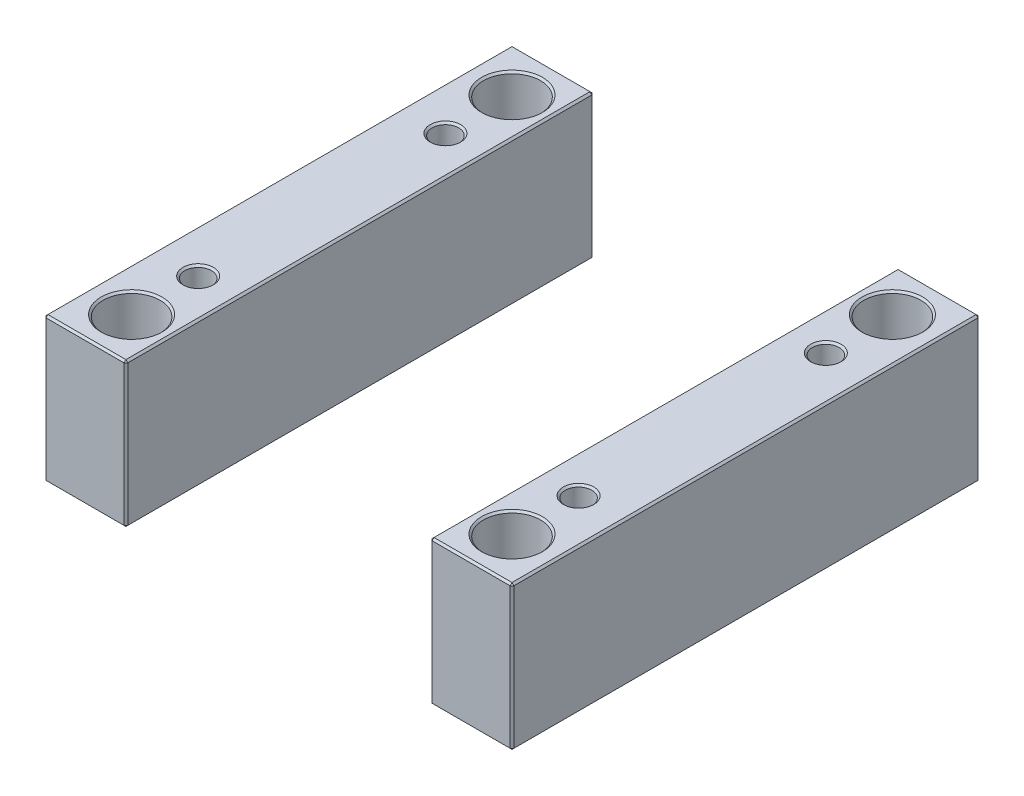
ISO-10303-21;
HEADER;
FILE_DESCRIPTION(('STEP AP214'),'2;1');
FILE_NAME('part.step','',(''),(''),'','','');
FILE_SCHEMA(('AUTOMOTIVE_DESIGN { 1 0 10303 214 1 1 1 1 }'));
ENDSEC;
DATA;
#1=APPLICATION_CONTEXT('core data for automotive mechanical design processes');
#2=APPLICATION_PROTOCOL_DEFINITION('international standard','automotive_design',2000,#1);
#3=PRODUCT_CONTEXT('',#1,'mechanical');
#4=PRODUCT('Part','Part','',(#3));
#5=PRODUCT_RELATED_PRODUCT_CATEGORY('part','',(#4));
#6=PRODUCT_DEFINITION_FORMATION('','',#4);
#7=PRODUCT_DEFINITION_CONTEXT('part definition',#1,'design');
#8=PRODUCT_DEFINITION('design','',#6,#7);
#9=PRODUCT_DEFINITION_SHAPE('','',#8);
#10=(LENGTH_UNIT() NAMED_UNIT(*) SI_UNIT(.MILLI.,.METRE.));
#11=(NAMED_UNIT(*) PLANE_ANGLE_UNIT() SI_UNIT($,.RADIAN.));
#12=(NAMED_UNIT(*) SI_UNIT($,.STERADIAN.) SOLID_ANGLE_UNIT());
#13=UNCERTAINTY_MEASURE_WITH_UNIT(LENGTH_MEASURE(1.E-05),#10,'distance_accuracy_value','');
#14=(GEOMETRIC_REPRESENTATION_CONTEXT(3) GLOBAL_UNCERTAINTY_ASSIGNED_CONTEXT((#13)) GLOBAL_UNIT_ASSIGNED_CONTEXT((#10,
#11,#12)) REPRESENTATION_CONTEXT('',''));
#15=CARTESIAN_POINT('',(0.,0.,0.));
#16=DIRECTION('',(0.,0.,1.));
#17=DIRECTION('',(1.,0.,0.));
#18=AXIS2_PLACEMENT_3D('',#15,#16,#17);
#19=CARTESIAN_POINT('',(-123.,76.,-123.));
#20=DIRECTION('',(0.,0.,1.));
#21=DIRECTION('',(1.,0.,0.));
#22=AXIS2_PLACEMENT_3D('',#19,#20,#21);
#23=PLANE('',#22);
#24=DIRECTION('',(-1.,0.,0.));
#25=VECTOR('',#24,1.);
#26=CARTESIAN_POINT('',(-123.,0.999999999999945,-123.));
#27=LINE('',#26,#25);
#28=CARTESIAN_POINT('',(-81.,0.999999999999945,-123.));
#29=VERTEX_POINT('',#28);
#30=CARTESIAN_POINT('',(-122.,0.999999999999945,-123.));
#31=VERTEX_POINT('',#30);
#32=EDGE_CURVE('P0_E137',#29,#31,#27,.T.);
#33=ORIENTED_EDGE('',*,*,#32,.T.);
#34=DIRECTION('',(0.,1.,0.));
#35=VECTOR('',#34,1.);
#36=CARTESIAN_POINT('',(-122.,76.,-123.));
#37=LINE('',#36,#35);
#38=CARTESIAN_POINT('',(-122.,75.,-123.));
#39=VERTEX_POINT('',#38);
#40=EDGE_CURVE('P0_E265',#31,#39,#37,.T.);
#41=ORIENTED_EDGE('',*,*,#40,.T.);
#42=DIRECTION('',(1.,0.,0.));
#43=VECTOR('',#42,1.);
#44=CARTESIAN_POINT('',(-123.,75.,-123.));
#45=LINE('',#44,#43);
#46=CARTESIAN_POINT('',(-81.,75.,-123.));
#47=VERTEX_POINT('',#46);
#48=EDGE_CURVE('P0_E263',#39,#47,#45,.T.);
#49=ORIENTED_EDGE('',*,*,#48,.T.);
#50=DIRECTION('',(0.,-1.,0.));
#51=VECTOR('',#50,1.);
#52=CARTESIAN_POINT('',(-81.,76.,-123.));
#53=LINE('',#52,#51);
#54=EDGE_CURVE('P0_E260',#47,#29,#53,.T.);
#55=ORIENTED_EDGE('',*,*,#54,.T.);
#56=EDGE_LOOP('',(#33,#41,#49,#55));
#57=FACE_BOUND('',#56,.T.);
#58=ADVANCED_FACE('P0_F16',(#57),#23,.F.);
#59=CARTESIAN_POINT('',(-123.,76.,123.));
#60=DIRECTION('',(1.,0.,0.));
#61=DIRECTION('',(0.,0.,-1.));
#62=AXIS2_PLACEMENT_3D('',#59,#60,#61);
#63=PLANE('',#62);
#64=DIRECTION('',(0.,1.,0.));
#65=VECTOR('',#64,1.);
#66=CARTESIAN_POINT('',(-123.,76.,122.));
#67=LINE('',#66,#65);
#68=CARTESIAN_POINT('',(-123.,0.999999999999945,122.));
#69=VERTEX_POINT('',#68);
#70=CARTESIAN_POINT('',(-123.,75.,122.));
#71=VERTEX_POINT('',#70);
#72=EDGE_CURVE('P0_E253',#69,#71,#67,.T.);
#73=ORIENTED_EDGE('',*,*,#72,.T.);
#74=DIRECTION('',(0.,0.,-1.));
#75=VECTOR('',#74,1.);
#76=CARTESIAN_POINT('',(-123.,75.,123.));
#77=LINE('',#76,#75);
#78=CARTESIAN_POINT('',(-123.,75.,-122.));
#79=VERTEX_POINT('',#78);
#80=EDGE_CURVE('P0_E258',#71,#79,#77,.T.);
#81=ORIENTED_EDGE('',*,*,#80,.T.);
#82=DIRECTION('',(0.,-1.,0.));
#83=VECTOR('',#82,1.);
#84=CARTESIAN_POINT('',(-123.,76.,-122.));
#85=LINE('',#84,#83);
#86=CARTESIAN_POINT('',(-123.,0.999999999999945,-122.));
#87=VERTEX_POINT('',#86);
#88=EDGE_CURVE('P0_E255',#79,#87,#85,.T.);
#89=ORIENTED_EDGE('',*,*,#88,.T.);
#90=DIRECTION('',(0.,0.,1.));
#91=VECTOR('',#90,1.);
#92=CARTESIAN_POINT('',(-123.,0.999999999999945,123.));
#93=LINE('',#92,#91);
#94=EDGE_CURVE('P0_E251',#87,#69,#93,.T.);
#95=ORIENTED_EDGE('',*,*,#94,.T.);
#96=EDGE_LOOP('',(#73,#81,#89,#95));
#97=FACE_BOUND('',#96,.T.);
#98=ADVANCED_FACE('P0_F333',(#97),#63,.F.);
#99=CARTESIAN_POINT('',(-123.,76.,123.));
#100=DIRECTION('',(0.,0.,-1.));
#101=DIRECTION('',(-1.,0.,0.));
#102=AXIS2_PLACEMENT_3D('',#99,#100,#101);
#103=PLANE('',#102);
#104=DIRECTION('',(-1.,0.,0.));
#105=VECTOR('',#104,1.);
#106=CARTESIAN_POINT('',(-123.,75.,123.));
#107=LINE('',#106,#105);
#108=CARTESIAN_POINT('',(-81.,75.,123.));
#109=VERTEX_POINT('',#108);
#110=CARTESIAN_POINT('',(-122.,75.,123.));
#111=VERTEX_POINT('',#110);
#112=EDGE_CURVE('P0_E272',#109,#111,#107,.T.);
#113=ORIENTED_EDGE('',*,*,#112,.T.);
#114=DIRECTION('',(0.,-1.,0.));
#115=VECTOR('',#114,1.);
#116=CARTESIAN_POINT('',(-122.,76.,123.));
#117=LINE('',#116,#115);
#118=CARTESIAN_POINT('',(-122.,0.999999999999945,123.));
#119=VERTEX_POINT('',#118);
#120=EDGE_CURVE('P0_E274',#111,#119,#117,.T.);
#121=ORIENTED_EDGE('',*,*,#120,.T.);
#122=DIRECTION('',(1.,0.,0.));
#123=VECTOR('',#122,1.);
#124=CARTESIAN_POINT('',(-80.,0.999999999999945,123.));
#125=LINE('',#124,#123);
#126=CARTESIAN_POINT('',(-81.,0.999999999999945,123.));
#127=VERTEX_POINT('',#126);
#128=EDGE_CURVE('P0_E270',#119,#127,#125,.T.);
#129=ORIENTED_EDGE('',*,*,#128,.T.);
#130=DIRECTION('',(0.,1.,0.));
#131=VECTOR('',#130,1.);
#132=CARTESIAN_POINT('',(-81.,76.,123.));
#133=LINE('',#132,#131);
#134=EDGE_CURVE('P0_E268',#127,#109,#133,.T.);
#135=ORIENTED_EDGE('',*,*,#134,.T.);
#136=EDGE_LOOP('',(#113,#121,#129,#135));
#137=FACE_BOUND('',#136,.T.);
#138=ADVANCED_FACE('P0_F372',(#137),#103,.F.);
#139=CARTESIAN_POINT('',(-80.,76.,-123.));
#140=DIRECTION('',(-1.,0.,0.));
#141=DIRECTION('',(0.,0.,1.));
#142=AXIS2_PLACEMENT_3D('',#139,#140,#141);
#143=PLANE('',#142);
#144=DIRECTION('',(0.,0.,1.));
#145=VECTOR('',#144,1.);
#146=CARTESIAN_POINT('',(-80.,75.,-123.));
#147=LINE('',#146,#145);
#148=CARTESIAN_POINT('',(-80.,75.,-122.));
#149=VERTEX_POINT('',#148);
#150=CARTESIAN_POINT('',(-80.,75.,122.));
#151=VERTEX_POINT('',#150);
#152=EDGE_CURVE('P0_E31',#149,#151,#147,.T.);
#153=ORIENTED_EDGE('',*,*,#152,.T.);
#154=DIRECTION('',(0.,-1.,0.));
#155=VECTOR('',#154,1.);
#156=CARTESIAN_POINT('',(-80.,76.,122.));
#157=LINE('',#156,#155);
#158=CARTESIAN_POINT('',(-80.,0.999999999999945,122.));
#159=VERTEX_POINT('',#158);
#160=EDGE_CURVE('P0_E190',#151,#159,#157,.T.);
#161=ORIENTED_EDGE('',*,*,#160,.T.);
#162=DIRECTION('',(0.,0.,-1.));
#163=VECTOR('',#162,1.);
#164=CARTESIAN_POINT('',(-80.,0.999999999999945,-123.));
#165=LINE('',#164,#163);
#166=CARTESIAN_POINT('',(-80.,0.999999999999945,-122.));
#167=VERTEX_POINT('',#166);
#168=EDGE_CURVE('P0_E286',#159,#167,#165,.T.);
#169=ORIENTED_EDGE('',*,*,#168,.T.);
#170=DIRECTION('',(0.,1.,0.));
#171=VECTOR('',#170,1.);
#172=CARTESIAN_POINT('',(-80.,76.,-122.));
#173=LINE('',#172,#171);
#174=EDGE_CURVE('P0_E36',#167,#149,#173,.T.);
#175=ORIENTED_EDGE('',*,*,#174,.T.);
#176=EDGE_LOOP('',(#153,#161,#169,#175));
#177=FACE_BOUND('',#176,.T.);
#178=ADVANCED_FACE('P0_F649',(#177),#143,.F.);
#179=CARTESIAN_POINT('',(0.,76.,0.));
#180=DIRECTION('',(0.,-1.,0.));
#181=DIRECTION('',(0.,0.,-1.));
#182=AXIS2_PLACEMENT_3D('',#179,#180,#181);
#183=PLANE('',#182);
#184=CARTESIAN_POINT('',(-100.,76.,-100.));
#185=DIRECTION('',(0.,-1.,0.));
#186=DIRECTION('',(0.,0.,-1.));
#187=AXIS2_PLACEMENT_3D('',#184,#185,#186);
#188=CIRCLE('',#187,16.);
#189=CARTESIAN_POINT('',(-100.,76.,-116.));
#190=VERTEX_POINT('',#189);
#191=EDGE_CURVE('P0_E214',#190,#190,#188,.T.);
#192=ORIENTED_EDGE('',*,*,#191,.T.);
#193=EDGE_LOOP('',(#192));
#194=FACE_BOUND('',#193,.T.);
#195=CARTESIAN_POINT('',(-100.,76.,100.));
#196=DIRECTION('',(0.,-1.,0.));
#197=DIRECTION('',(0.,0.,-1.));
#198=AXIS2_PLACEMENT_3D('',#195,#196,#197);
#199=CIRCLE('',#198,16.);
#200=CARTESIAN_POINT('',(-100.,76.,84.));
#201=VERTEX_POINT('',#200);
#202=EDGE_CURVE('P0_E211',#201,#201,#199,.T.);
#203=ORIENTED_EDGE('',*,*,#202,.T.);
#204=EDGE_LOOP('',(#203));
#205=FACE_BOUND('',#204,.T.);
#206=CARTESIAN_POINT('',(-100.,76.,65.));
#207=DIRECTION('',(0.,-1.,0.));
#208=DIRECTION('',(0.,0.,-1.));
#209=AXIS2_PLACEMENT_3D('',#206,#207,#208);
#210=CIRCLE('',#209,8.);
#211=CARTESIAN_POINT('',(-100.,76.,57.));
#212=VERTEX_POINT('',#211);
#213=EDGE_CURVE('P0_E193',#212,#212,#210,.T.);
#214=ORIENTED_EDGE('',*,*,#213,.T.);
#215=EDGE_LOOP('',(#214));
#216=FACE_BOUND('',#215,.T.);
#217=CARTESIAN_POINT('',(-100.,76.,-65.));
#218=DIRECTION('',(0.,-1.,0.));
#219=DIRECTION('',(0.,0.,-1.));
#220=AXIS2_PLACEMENT_3D('',#217,#218,#219);
#221=CIRCLE('',#220,8.);
#222=CARTESIAN_POINT('',(-100.,76.,-73.));
#223=VERTEX_POINT('',#222);
#224=EDGE_CURVE('P0_E189',#223,#223,#221,.T.);
#225=ORIENTED_EDGE('',*,*,#224,.T.);
#226=EDGE_LOOP('',(#225));
#227=FACE_BOUND('',#226,.T.);
#228=DIRECTION('',(0.,0.,1.));
#229=VECTOR('',#228,1.);
#230=CARTESIAN_POINT('',(-122.,76.,0.));
#231=LINE('',#230,#229);
#232=CARTESIAN_POINT('',(-122.,76.,-122.));
#233=VERTEX_POINT('',#232);
#234=CARTESIAN_POINT('',(-122.,76.,122.));
#235=VERTEX_POINT('',#234);
#236=EDGE_CURVE('P0_E281',#233,#235,#231,.T.);
#237=ORIENTED_EDGE('',*,*,#236,.T.);
#238=DIRECTION('',(1.,0.,0.));
#239=VECTOR('',#238,1.);
#240=CARTESIAN_POINT('',(0.,76.,122.));
#241=LINE('',#240,#239);
#242=CARTESIAN_POINT('',(-81.,76.,122.));
#243=VERTEX_POINT('',#242);
#244=EDGE_CURVE('P0_E283',#235,#243,#241,.T.);
#245=ORIENTED_EDGE('',*,*,#244,.T.);
#246=DIRECTION('',(0.,0.,-1.));
#247=VECTOR('',#246,1.);
#248=CARTESIAN_POINT('',(-81.,76.,0.));
#249=LINE('',#248,#247);
#250=CARTESIAN_POINT('',(-81.,76.,-122.));
#251=VERTEX_POINT('',#250);
#252=EDGE_CURVE('P0_E277',#243,#251,#249,.T.);
#253=ORIENTED_EDGE('',*,*,#252,.T.);
#254=DIRECTION('',(-1.,0.,0.));
#255=VECTOR('',#254,1.);
#256=CARTESIAN_POINT('',(0.,76.,-122.));
#257=LINE('',#256,#255);
#258=EDGE_CURVE('P0_E279',#251,#233,#257,.T.);
#259=ORIENTED_EDGE('',*,*,#258,.T.);
#260=EDGE_LOOP('',(#237,#245,#253,#259));
#261=FACE_BOUND('',#260,.T.);
#262=ADVANCED_FACE('P0_F229',(#194,#205,#216,#227,#261),#183,.F.);
#263=CARTESIAN_POINT('',(0.,0.,0.));
#264=DIRECTION('',(0.,-1.,0.));
#265=DIRECTION('',(0.,0.,-1.));
#266=AXIS2_PLACEMENT_3D('',#263,#264,#265);
#267=PLANE('',#266);
#268=CARTESIAN_POINT('',(-100.,0.,-100.));
#269=DIRECTION('',(0.,-1.,0.));
#270=DIRECTION('',(0.,0.,-1.));
#271=AXIS2_PLACEMENT_3D('',#268,#269,#270);
#272=CIRCLE('',#271,16.);
#273=CARTESIAN_POINT('',(-100.,0.,-116.));
#274=VERTEX_POINT('',#273);
#275=EDGE_CURVE('P0_E202',#274,#274,#272,.F.);
#276=ORIENTED_EDGE('',*,*,#275,.T.);
#277=EDGE_LOOP('',(#276));
#278=FACE_BOUND('',#277,.T.);
#279=CARTESIAN_POINT('',(-100.,0.,100.));
#280=DIRECTION('',(0.,-1.,0.));
#281=DIRECTION('',(0.,0.,-1.));
#282=AXIS2_PLACEMENT_3D('',#279,#280,#281);
#283=CIRCLE('',#282,16.);
#284=CARTESIAN_POINT('',(-100.,0.,84.));
#285=VERTEX_POINT('',#284);
#286=EDGE_CURVE('P0_E199',#285,#285,#283,.F.);
#287=ORIENTED_EDGE('',*,*,#286,.T.);
#288=EDGE_LOOP('',(#287));
#289=FACE_BOUND('',#288,.T.);
#290=CARTESIAN_POINT('',(-100.,0.,-65.));
#291=DIRECTION('',(0.,-1.,0.));
#292=DIRECTION('',(0.,0.,-1.));
#293=AXIS2_PLACEMENT_3D('',#290,#291,#292);
#294=CIRCLE('',#293,8.);
#295=CARTESIAN_POINT('',(-100.,0.,-73.));
#296=VERTEX_POINT('',#295);
#297=EDGE_CURVE('P0_E235',#296,#296,#294,.F.);
#298=ORIENTED_EDGE('',*,*,#297,.T.);
#299=EDGE_LOOP('',(#298));
#300=FACE_BOUND('',#299,.T.);
#301=CARTESIAN_POINT('',(-100.,0.,65.));
#302=DIRECTION('',(0.,-1.,0.));
#303=DIRECTION('',(0.,0.,-1.));
#304=AXIS2_PLACEMENT_3D('',#301,#302,#303);
#305=CIRCLE('',#304,8.);
#306=CARTESIAN_POINT('',(-100.,0.,57.));
#307=VERTEX_POINT('',#306);
#308=EDGE_CURVE('P0_E238',#307,#307,#305,.F.);
#309=ORIENTED_EDGE('',*,*,#308,.T.);
#310=EDGE_LOOP('',(#309));
#311=FACE_BOUND('',#310,.T.);
#312=DIRECTION('',(-1.,0.,0.));
#313=VECTOR('',#312,1.);
#314=CARTESIAN_POINT('',(-123.,0.,122.));
#315=LINE('',#314,#313);
#316=CARTESIAN_POINT('',(-81.,0.,122.));
#317=VERTEX_POINT('',#316);
#318=CARTESIAN_POINT('',(-122.,0.,122.));
#319=VERTEX_POINT('',#318);
#320=EDGE_CURVE('P0_E114',#317,#319,#315,.T.);
#321=ORIENTED_EDGE('',*,*,#320,.T.);
#322=DIRECTION('',(0.,0.,-1.));
#323=VECTOR('',#322,1.);
#324=CARTESIAN_POINT('',(-122.,0.,-123.));
#325=LINE('',#324,#323);
#326=CARTESIAN_POINT('',(-122.,0.,-122.));
#327=VERTEX_POINT('',#326);
#328=EDGE_CURVE('P0_E110',#319,#327,#325,.T.);
#329=ORIENTED_EDGE('',*,*,#328,.T.);
#330=DIRECTION('',(1.,0.,0.));
#331=VECTOR('',#330,1.);
#332=CARTESIAN_POINT('',(-80.,0.,-122.));
#333=LINE('',#332,#331);
#334=CARTESIAN_POINT('',(-81.,0.,-122.));
#335=VERTEX_POINT('',#334);
#336=EDGE_CURVE('P0_E104',#327,#335,#333,.T.);
#337=ORIENTED_EDGE('',*,*,#336,.T.);
#338=DIRECTION('',(0.,0.,1.));
#339=VECTOR('',#338,1.);
#340=CARTESIAN_POINT('',(-81.,0.,123.));
#341=LINE('',#340,#339);
#342=EDGE_CURVE('P0_E107',#335,#317,#341,.T.);
#343=ORIENTED_EDGE('',*,*,#342,.T.);
#344=EDGE_LOOP('',(#321,#329,#337,#343));
#345=FACE_BOUND('',#344,.T.);
#346=ADVANCED_FACE('P0_F106',(#278,#289,#300,#311,#345),#267,.T.);
#347=CARTESIAN_POINT('',(-100.,0.,-65.));
#348=DIRECTION('',(0.,1.,0.));
#349=DIRECTION('',(0.,0.,1.));
#350=AXIS2_PLACEMENT_3D('',#347,#348,#349);
#351=CYLINDRICAL_SURFACE('',#350,7.);
#352=CARTESIAN_POINT('',(-100.,75.,-65.));
#353=DIRECTION('',(0.,-1.,0.));
#354=DIRECTION('',(0.,0.,-1.));
#355=AXIS2_PLACEMENT_3D('',#352,#353,#354);
#356=CIRCLE('',#355,7.);
#357=CARTESIAN_POINT('',(-100.,75.,-72.));
#358=VERTEX_POINT('',#357);
#359=EDGE_CURVE('P0_E196',#358,#358,#356,.F.);
#360=ORIENTED_EDGE('',*,*,#359,.T.);
#361=EDGE_LOOP('',(#360));
#362=FACE_BOUND('',#361,.T.);
#363=CARTESIAN_POINT('',(-100.,0.999999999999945,-65.));
#364=DIRECTION('',(0.,-1.,0.));
#365=DIRECTION('',(0.,0.,-1.));
#366=AXIS2_PLACEMENT_3D('',#363,#364,#365);
#367=CIRCLE('',#366,7.);
#368=CARTESIAN_POINT('',(-100.,0.999999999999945,-72.));
#369=VERTEX_POINT('',#368);
#370=EDGE_CURVE('P0_E241',#369,#369,#367,.T.);
#371=ORIENTED_EDGE('',*,*,#370,.T.);
#372=EDGE_LOOP('',(#371));
#373=FACE_BOUND('',#372,.T.);
#374=ADVANCED_FACE('P0_F228',(#362,#373),#351,.F.);
#375=CARTESIAN_POINT('',(-100.,0.,65.));
#376=DIRECTION('',(0.,1.,0.));
#377=DIRECTION('',(0.,0.,1.));
#378=AXIS2_PLACEMENT_3D('',#375,#376,#377);
#379=CYLINDRICAL_SURFACE('',#378,7.);
#380=CARTESIAN_POINT('',(-100.,75.,65.));
#381=DIRECTION('',(0.,-1.,0.));
#382=DIRECTION('',(0.,0.,-1.));
#383=AXIS2_PLACEMENT_3D('',#380,#381,#382);
#384=CIRCLE('',#383,7.);
#385=CARTESIAN_POINT('',(-100.,75.,58.));
#386=VERTEX_POINT('',#385);
#387=EDGE_CURVE('P0_E186',#386,#386,#384,.F.);
#388=ORIENTED_EDGE('',*,*,#387,.T.);
#389=EDGE_LOOP('',(#388));
#390=FACE_BOUND('',#389,.T.);
#391=CARTESIAN_POINT('',(-100.,1.00000000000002,65.));
#392=DIRECTION('',(0.,-1.,0.));
#393=DIRECTION('',(0.,0.,-1.));
#394=AXIS2_PLACEMENT_3D('',#391,#392,#393);
#395=CIRCLE('',#394,7.);
#396=CARTESIAN_POINT('',(-100.,1.00000000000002,58.));
#397=VERTEX_POINT('',#396);
#398=EDGE_CURVE('P0_E248',#397,#397,#395,.T.);
#399=ORIENTED_EDGE('',*,*,#398,.T.);
#400=EDGE_LOOP('',(#399));
#401=FACE_BOUND('',#400,.T.);
#402=ADVANCED_FACE('P0_F380',(#390,#401),#379,.F.);
#403=CARTESIAN_POINT('',(-100.,0.,-65.));
#404=DIRECTION('',(0.,-1.,0.));
#405=DIRECTION('',(0.,0.,-1.));
#406=AXIS2_PLACEMENT_3D('',#403,#404,#405);
#407=CONICAL_SURFACE('',#406,8.,0.78539816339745);
#408=ORIENTED_EDGE('',*,*,#370,.F.);
#409=EDGE_LOOP('',(#408));
#410=FACE_BOUND('',#409,.T.);
#411=ORIENTED_EDGE('',*,*,#297,.F.);
#412=EDGE_LOOP('',(#411));
#413=FACE_BOUND('',#412,.T.);
#414=ADVANCED_FACE('P0_F376',(#410,#413),#407,.F.);
#415=CARTESIAN_POINT('',(-100.,0.,65.));
#416=DIRECTION('',(0.,-1.,0.));
#417=DIRECTION('',(0.,0.,-1.));
#418=AXIS2_PLACEMENT_3D('',#415,#416,#417);
#419=CONICAL_SURFACE('',#418,8.,0.785398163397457);
#420=ORIENTED_EDGE('',*,*,#398,.F.);
#421=EDGE_LOOP('',(#420));
#422=FACE_BOUND('',#421,.T.);
#423=ORIENTED_EDGE('',*,*,#308,.F.);
#424=EDGE_LOOP('',(#423));
#425=FACE_BOUND('',#424,.T.);
#426=ADVANCED_FACE('P0_F379',(#422,#425),#419,.F.);
#427=CARTESIAN_POINT('',(-80.,76.,122.));
#428=DIRECTION('',(-0.707106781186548,0.,-0.707106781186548));
#429=DIRECTION('',(0.,-1.,0.));
#430=AXIS2_PLACEMENT_3D('',#427,#428,#429);
#431=PLANE('',#430);
#432=DIRECTION('',(-0.707106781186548,0.,0.707106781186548));
#433=VECTOR('',#432,1.);
#434=CARTESIAN_POINT('',(-80.5,75.,122.5));
#435=LINE('',#434,#433);
#436=EDGE_CURVE('P0_E125',#109,#151,#435,.F.);
#437=ORIENTED_EDGE('',*,*,#436,.F.);
#438=ORIENTED_EDGE('',*,*,#134,.F.);
#439=DIRECTION('',(0.707106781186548,0.,-0.707106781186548));
#440=VECTOR('',#439,1.);
#441=CARTESIAN_POINT('',(-81.,0.999999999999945,123.));
#442=LINE('',#441,#440);
#443=EDGE_CURVE('P0_E181',#159,#127,#442,.F.);
#444=ORIENTED_EDGE('',*,*,#443,.F.);
#445=ORIENTED_EDGE('',*,*,#160,.F.);
#446=EDGE_LOOP('',(#437,#438,#444,#445));
#447=FACE_BOUND('',#446,.T.);
#448=ADVANCED_FACE('P0_F384',(#447),#431,.F.);
#449=CARTESIAN_POINT('',(-81.,76.,122.));
#450=DIRECTION('',(0.577350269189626,0.577350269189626,0.577350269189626));
#451=DIRECTION('',(0.707106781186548,0.,-0.707106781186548));
#452=AXIS2_PLACEMENT_3D('',#449,#450,#451);
#453=PLANE('',#452);
#454=DIRECTION('',(0.,0.707106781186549,-0.707106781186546));
#455=VECTOR('',#454,1.);
#456=CARTESIAN_POINT('',(-81.,76.,122.));
#457=LINE('',#456,#455);
#458=EDGE_CURVE('P0_E175',#109,#243,#457,.T.);
#459=ORIENTED_EDGE('',*,*,#458,.F.);
#460=ORIENTED_EDGE('',*,*,#436,.T.);
#461=DIRECTION('',(0.707106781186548,-0.707106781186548,0.));
#462=VECTOR('',#461,1.);
#463=CARTESIAN_POINT('',(-81.,76.,122.));
#464=LINE('',#463,#462);
#465=EDGE_CURVE('P0_E178',#243,#151,#464,.T.);
#466=ORIENTED_EDGE('',*,*,#465,.F.);
#467=EDGE_LOOP('',(#459,#460,#466));
#468=FACE_BOUND('',#467,.T.);
#469=ADVANCED_FACE('P0_F588',(#468),#453,.T.);
#470=CARTESIAN_POINT('',(-81.,0.999999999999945,123.));
#471=DIRECTION('',(0.577350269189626,-0.577350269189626,0.577350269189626));
#472=DIRECTION('',(0.707106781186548,0.,-0.707106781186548));
#473=AXIS2_PLACEMENT_3D('',#470,#471,#472);
#474=PLANE('',#473);
#475=DIRECTION('',(0.707106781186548,0.707106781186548,0.));
#476=VECTOR('',#475,1.);
#477=CARTESIAN_POINT('',(-80.5,0.499999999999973,122.));
#478=LINE('',#477,#476);
#479=EDGE_CURVE('P0_E123',#159,#317,#478,.F.);
#480=ORIENTED_EDGE('',*,*,#479,.F.);
#481=ORIENTED_EDGE('',*,*,#443,.T.);
#482=DIRECTION('',(0.,-0.707106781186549,-0.707106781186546));
#483=VECTOR('',#482,1.);
#484=CARTESIAN_POINT('',(-81.,0.999999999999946,123.));
#485=LINE('',#484,#483);
#486=EDGE_CURVE('P0_E172',#317,#127,#485,.F.);
#487=ORIENTED_EDGE('',*,*,#486,.F.);
#488=EDGE_LOOP('',(#480,#481,#487));
#489=FACE_BOUND('',#488,.T.);
#490=ADVANCED_FACE('P0_F597',(#489),#474,.T.);
#491=CARTESIAN_POINT('',(-81.,76.,0.));
#492=DIRECTION('',(-0.707106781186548,-0.707106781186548,0.));
#493=DIRECTION('',(0.,0.,-1.));
#494=AXIS2_PLACEMENT_3D('',#491,#492,#493);
#495=PLANE('',#494);
#496=ORIENTED_EDGE('',*,*,#465,.T.);
#497=ORIENTED_EDGE('',*,*,#152,.F.);
#498=DIRECTION('',(-0.707106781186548,0.707106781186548,0.));
#499=VECTOR('',#498,1.);
#500=CARTESIAN_POINT('',(-80.5,75.5,-122.));
#501=LINE('',#500,#499);
#502=EDGE_CURVE('P0_E165',#251,#149,#501,.F.);
#503=ORIENTED_EDGE('',*,*,#502,.F.);
#504=ORIENTED_EDGE('',*,*,#252,.F.);
#505=EDGE_LOOP('',(#496,#497,#503,#504));
#506=FACE_BOUND('',#505,.T.);
#507=ADVANCED_FACE('P0_F349',(#506),#495,.F.);
#508=CARTESIAN_POINT('',(0.,76.,122.));
#509=DIRECTION('',(0.,-0.707106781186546,-0.707106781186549));
#510=DIRECTION('',(1.,0.,0.));
#511=AXIS2_PLACEMENT_3D('',#508,#509,#510);
#512=PLANE('',#511);
#513=ORIENTED_EDGE('',*,*,#458,.T.);
#514=ORIENTED_EDGE('',*,*,#244,.F.);
#515=DIRECTION('',(0.,-0.707106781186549,0.707106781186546));
#516=VECTOR('',#515,1.);
#517=CARTESIAN_POINT('',(-122.,75.5,122.5));
#518=LINE('',#517,#516);
#519=EDGE_CURVE('P0_E162',#111,#235,#518,.F.);
#520=ORIENTED_EDGE('',*,*,#519,.F.);
#521=ORIENTED_EDGE('',*,*,#112,.F.);
#522=EDGE_LOOP('',(#513,#514,#520,#521));
#523=FACE_BOUND('',#522,.T.);
#524=ADVANCED_FACE('P0_F344',(#523),#512,.F.);
#525=CARTESIAN_POINT('',(-122.,76.,123.));
#526=DIRECTION('',(0.707106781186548,0.,-0.707106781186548));
#527=DIRECTION('',(0.,-1.,0.));
#528=AXIS2_PLACEMENT_3D('',#525,#526,#527);
#529=PLANE('',#528);
#530=DIRECTION('',(0.707106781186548,0.,0.707106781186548));
#531=VECTOR('',#530,1.);
#532=CARTESIAN_POINT('',(-122.,0.999999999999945,123.));
#533=LINE('',#532,#531);
#534=EDGE_CURVE('P0_E156',#119,#69,#533,.F.);
#535=ORIENTED_EDGE('',*,*,#534,.F.);
#536=ORIENTED_EDGE('',*,*,#120,.F.);
#537=DIRECTION('',(-0.707106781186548,0.,-0.707106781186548));
#538=VECTOR('',#537,1.);
#539=CARTESIAN_POINT('',(-123.,75.,122.));
#540=LINE('',#539,#538);
#541=EDGE_CURVE('P0_E159',#71,#111,#540,.F.);
#542=ORIENTED_EDGE('',*,*,#541,.F.);
#543=ORIENTED_EDGE('',*,*,#72,.F.);
#544=EDGE_LOOP('',(#535,#536,#542,#543));
#545=FACE_BOUND('',#544,.T.);
#546=ADVANCED_FACE('P0_F338',(#545),#529,.F.);
#547=CARTESIAN_POINT('',(-123.,0.999999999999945,123.));
#548=DIRECTION('',(0.,-0.707106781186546,0.707106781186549));
#549=DIRECTION('',(-1.,0.,0.));
#550=AXIS2_PLACEMENT_3D('',#547,#548,#549);
#551=PLANE('',#550);
#552=ORIENTED_EDGE('',*,*,#486,.T.);
#553=ORIENTED_EDGE('',*,*,#128,.F.);
#554=DIRECTION('',(0.,0.707106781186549,0.707106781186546));
#555=VECTOR('',#554,1.);
#556=CARTESIAN_POINT('',(-122.,0.999999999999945,123.));
#557=LINE('',#556,#555);
#558=EDGE_CURVE('P0_E134',#319,#119,#557,.T.);
#559=ORIENTED_EDGE('',*,*,#558,.F.);
#560=ORIENTED_EDGE('',*,*,#320,.F.);
#561=EDGE_LOOP('',(#552,#553,#559,#560));
#562=FACE_BOUND('',#561,.T.);
#563=ADVANCED_FACE('P0_F364',(#562),#551,.T.);
#564=CARTESIAN_POINT('',(-80.,0.999999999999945,-123.));
#565=DIRECTION('',(0.707106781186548,-0.707106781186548,0.));
#566=DIRECTION('',(0.,0.,1.));
#567=AXIS2_PLACEMENT_3D('',#564,#565,#566);
#568=PLANE('',#567);
#569=ORIENTED_EDGE('',*,*,#479,.T.);
#570=ORIENTED_EDGE('',*,*,#342,.F.);
#571=DIRECTION('',(-0.707106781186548,-0.707106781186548,0.));
#572=VECTOR('',#571,1.);
#573=CARTESIAN_POINT('',(-81.,0.,-122.));
#574=LINE('',#573,#572);
#575=EDGE_CURVE('P0_E120',#167,#335,#574,.T.);
#576=ORIENTED_EDGE('',*,*,#575,.F.);
#577=ORIENTED_EDGE('',*,*,#168,.F.);
#578=EDGE_LOOP('',(#569,#570,#576,#577));
#579=FACE_BOUND('',#578,.T.);
#580=ADVANCED_FACE('P0_F119',(#579),#568,.T.);
#581=CARTESIAN_POINT('',(-81.,76.,-123.));
#582=DIRECTION('',(-0.707106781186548,0.,0.707106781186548));
#583=DIRECTION('',(0.,-1.,0.));
#584=AXIS2_PLACEMENT_3D('',#581,#582,#583);
#585=PLANE('',#584);
#586=DIRECTION('',(0.707106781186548,0.,0.707106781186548));
#587=VECTOR('',#586,1.);
#588=CARTESIAN_POINT('',(-81.,75.,-123.));
#589=LINE('',#588,#587);
#590=EDGE_CURVE('P0_E168',#149,#47,#589,.F.);
#591=ORIENTED_EDGE('',*,*,#590,.F.);
#592=ORIENTED_EDGE('',*,*,#174,.F.);
#593=DIRECTION('',(-0.707106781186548,0.,-0.707106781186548));
#594=VECTOR('',#593,1.);
#595=CARTESIAN_POINT('',(-80.5,0.999999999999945,-122.5));
#596=LINE('',#595,#594);
#597=EDGE_CURVE('P0_E133',#29,#167,#596,.F.);
#598=ORIENTED_EDGE('',*,*,#597,.F.);
#599=ORIENTED_EDGE('',*,*,#54,.F.);
#600=EDGE_LOOP('',(#591,#592,#598,#599));
#601=FACE_BOUND('',#600,.T.);
#602=ADVANCED_FACE('P0_F354',(#601),#585,.F.);
#603=CARTESIAN_POINT('',(-81.,75.,-123.));
#604=DIRECTION('',(0.577350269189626,0.577350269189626,-0.577350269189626));
#605=DIRECTION('',(-0.707106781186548,0.,-0.707106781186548));
#606=AXIS2_PLACEMENT_3D('',#603,#604,#605);
#607=PLANE('',#606);
#608=ORIENTED_EDGE('',*,*,#502,.T.);
#609=ORIENTED_EDGE('',*,*,#590,.T.);
#610=DIRECTION('',(0.,-0.707106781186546,-0.707106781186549));
#611=VECTOR('',#610,1.);
#612=CARTESIAN_POINT('',(-81.,75.,-123.));
#613=LINE('',#612,#611);
#614=EDGE_CURVE('P0_E151',#251,#47,#613,.T.);
#615=ORIENTED_EDGE('',*,*,#614,.F.);
#616=EDGE_LOOP('',(#608,#609,#615));
#617=FACE_BOUND('',#616,.T.);
#618=ADVANCED_FACE('P0_F352',(#617),#607,.T.);
#619=CARTESIAN_POINT('',(-123.,75.,122.));
#620=DIRECTION('',(-0.577350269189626,0.577350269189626,0.577350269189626));
#621=DIRECTION('',(0.707106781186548,0.,0.707106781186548));
#622=AXIS2_PLACEMENT_3D('',#619,#620,#621);
#623=PLANE('',#622);
#624=ORIENTED_EDGE('',*,*,#541,.T.);
#625=ORIENTED_EDGE('',*,*,#519,.T.);
#626=DIRECTION('',(0.707106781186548,0.707106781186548,0.));
#627=VECTOR('',#626,1.);
#628=CARTESIAN_POINT('',(-123.,75.,122.));
#629=LINE('',#628,#627);
#630=EDGE_CURVE('P0_E142',#71,#235,#629,.T.);
#631=ORIENTED_EDGE('',*,*,#630,.F.);
#632=EDGE_LOOP('',(#624,#625,#631));
#633=FACE_BOUND('',#632,.T.);
#634=ADVANCED_FACE('P0_F341',(#633),#623,.T.);
#635=CARTESIAN_POINT('',(-122.,0.999999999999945,123.));
#636=DIRECTION('',(-0.577350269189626,-0.577350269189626,0.577350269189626));
#637=DIRECTION('',(0.707106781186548,0.,0.707106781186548));
#638=AXIS2_PLACEMENT_3D('',#635,#636,#637);
#639=PLANE('',#638);
#640=ORIENTED_EDGE('',*,*,#558,.T.);
#641=ORIENTED_EDGE('',*,*,#534,.T.);
#642=DIRECTION('',(0.707106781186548,-0.707106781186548,0.));
#643=VECTOR('',#642,1.);
#644=CARTESIAN_POINT('',(-122.5,0.499999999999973,122.));
#645=LINE('',#644,#643);
#646=EDGE_CURVE('P0_E138',#319,#69,#645,.F.);
#647=ORIENTED_EDGE('',*,*,#646,.F.);
#648=EDGE_LOOP('',(#640,#641,#647));
#649=FACE_BOUND('',#648,.T.);
#650=ADVANCED_FACE('P0_F403',(#649),#639,.T.);
#651=CARTESIAN_POINT('',(-81.,0.,-122.));
#652=DIRECTION('',(0.577350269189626,-0.577350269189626,-0.577350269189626));
#653=DIRECTION('',(-0.707106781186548,0.,-0.707106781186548));
#654=AXIS2_PLACEMENT_3D('',#651,#652,#653);
#655=PLANE('',#654);
#656=ORIENTED_EDGE('',*,*,#597,.T.);
#657=ORIENTED_EDGE('',*,*,#575,.T.);
#658=DIRECTION('',(0.,0.707106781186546,-0.707106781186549));
#659=VECTOR('',#658,1.);
#660=CARTESIAN_POINT('',(-81.,0.,-122.));
#661=LINE('',#660,#659);
#662=EDGE_CURVE('P0_E130',#29,#335,#661,.F.);
#663=ORIENTED_EDGE('',*,*,#662,.F.);
#664=EDGE_LOOP('',(#656,#657,#663));
#665=FACE_BOUND('',#664,.T.);
#666=ADVANCED_FACE('P0_F129',(#665),#655,.T.);
#667=CARTESIAN_POINT('',(0.,76.,-122.));
#668=DIRECTION('',(0.,-0.707106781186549,0.707106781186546));
#669=DIRECTION('',(-1.,0.,0.));
#670=AXIS2_PLACEMENT_3D('',#667,#668,#669);
#671=PLANE('',#670);
#672=ORIENTED_EDGE('',*,*,#614,.T.);
#673=ORIENTED_EDGE('',*,*,#48,.F.);
#674=DIRECTION('',(0.,0.707106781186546,0.707106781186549));
#675=VECTOR('',#674,1.);
#676=CARTESIAN_POINT('',(-122.,75.,-123.));
#677=LINE('',#676,#675);
#678=EDGE_CURVE('P0_E139',#233,#39,#677,.F.);
#679=ORIENTED_EDGE('',*,*,#678,.F.);
#680=ORIENTED_EDGE('',*,*,#258,.F.);
#681=EDGE_LOOP('',(#672,#673,#679,#680));
#682=FACE_BOUND('',#681,.T.);
#683=ADVANCED_FACE('P0_F316',(#682),#671,.F.);
#684=CARTESIAN_POINT('',(-122.,76.,0.));
#685=DIRECTION('',(0.707106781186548,-0.707106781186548,0.));
#686=DIRECTION('',(0.,0.,1.));
#687=AXIS2_PLACEMENT_3D('',#684,#685,#686);
#688=PLANE('',#687);
#689=ORIENTED_EDGE('',*,*,#630,.T.);
#690=ORIENTED_EDGE('',*,*,#236,.F.);
#691=DIRECTION('',(-0.707106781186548,-0.707106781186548,0.));
#692=VECTOR('',#691,1.);
#693=CARTESIAN_POINT('',(-122.5,75.5,-122.));
#694=LINE('',#693,#692);
#695=EDGE_CURVE('P0_E145',#79,#233,#694,.F.);
#696=ORIENTED_EDGE('',*,*,#695,.F.);
#697=ORIENTED_EDGE('',*,*,#80,.F.);
#698=EDGE_LOOP('',(#689,#690,#696,#697));
#699=FACE_BOUND('',#698,.T.);
#700=ADVANCED_FACE('P0_F310',(#699),#688,.F.);
#701=CARTESIAN_POINT('',(-123.,0.999999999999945,123.));
#702=DIRECTION('',(-0.707106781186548,-0.707106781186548,0.));
#703=DIRECTION('',(0.,0.,-1.));
#704=AXIS2_PLACEMENT_3D('',#701,#702,#703);
#705=PLANE('',#704);
#706=ORIENTED_EDGE('',*,*,#646,.T.);
#707=ORIENTED_EDGE('',*,*,#94,.F.);
#708=DIRECTION('',(-0.707106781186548,0.707106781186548,0.));
#709=VECTOR('',#708,1.);
#710=CARTESIAN_POINT('',(-123.,0.999999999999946,-122.));
#711=LINE('',#710,#709);
#712=EDGE_CURVE('P0_E297',#327,#87,#711,.T.);
#713=ORIENTED_EDGE('',*,*,#712,.F.);
#714=ORIENTED_EDGE('',*,*,#328,.F.);
#715=EDGE_LOOP('',(#706,#707,#713,#714));
#716=FACE_BOUND('',#715,.T.);
#717=ADVANCED_FACE('P0_F329',(#716),#705,.T.);
#718=CARTESIAN_POINT('',(-123.,0.999999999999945,-123.));
#719=DIRECTION('',(0.,-0.707106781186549,-0.707106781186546));
#720=DIRECTION('',(1.,0.,0.));
#721=AXIS2_PLACEMENT_3D('',#718,#719,#720);
#722=PLANE('',#721);
#723=ORIENTED_EDGE('',*,*,#662,.T.);
#724=ORIENTED_EDGE('',*,*,#336,.F.);
#725=DIRECTION('',(0.,-0.707106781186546,0.707106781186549));
#726=VECTOR('',#725,1.);
#727=CARTESIAN_POINT('',(-122.,0.499999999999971,-122.5));
#728=LINE('',#727,#726);
#729=EDGE_CURVE('P0_E295',#31,#327,#728,.T.);
#730=ORIENTED_EDGE('',*,*,#729,.F.);
#731=ORIENTED_EDGE('',*,*,#32,.F.);
#732=EDGE_LOOP('',(#723,#724,#730,#731));
#733=FACE_BOUND('',#732,.T.);
#734=ADVANCED_FACE('P0_F136',(#733),#722,.T.);
#735=CARTESIAN_POINT('',(-122.,75.,-123.));
#736=DIRECTION('',(-0.577350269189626,0.577350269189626,-0.577350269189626));
#737=DIRECTION('',(-0.707106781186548,0.,0.707106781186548));
#738=AXIS2_PLACEMENT_3D('',#735,#736,#737);
#739=PLANE('',#738);
#740=ORIENTED_EDGE('',*,*,#695,.T.);
#741=ORIENTED_EDGE('',*,*,#678,.T.);
#742=DIRECTION('',(0.707106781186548,0.,-0.707106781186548));
#743=VECTOR('',#742,1.);
#744=CARTESIAN_POINT('',(-122.,75.,-123.));
#745=LINE('',#744,#743);
#746=EDGE_CURVE('P0_E293',#79,#39,#745,.T.);
#747=ORIENTED_EDGE('',*,*,#746,.F.);
#748=EDGE_LOOP('',(#740,#741,#747));
#749=FACE_BOUND('',#748,.T.);
#750=ADVANCED_FACE('P0_F303',(#749),#739,.T.);
#751=CARTESIAN_POINT('',(-123.,0.999999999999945,-122.));
#752=DIRECTION('',(-0.577350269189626,-0.577350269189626,-0.577350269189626));
#753=DIRECTION('',(-0.707106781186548,0.,0.707106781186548));
#754=AXIS2_PLACEMENT_3D('',#751,#752,#753);
#755=PLANE('',#754);
#756=ORIENTED_EDGE('',*,*,#729,.T.);
#757=ORIENTED_EDGE('',*,*,#712,.T.);
#758=DIRECTION('',(-0.707106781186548,0.,0.707106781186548));
#759=VECTOR('',#758,1.);
#760=CARTESIAN_POINT('',(-123.,0.999999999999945,-122.));
#761=LINE('',#760,#759);
#762=EDGE_CURVE('P0_E291',#31,#87,#761,.T.);
#763=ORIENTED_EDGE('',*,*,#762,.F.);
#764=EDGE_LOOP('',(#756,#757,#763));
#765=FACE_BOUND('',#764,.T.);
#766=ADVANCED_FACE('P0_F325',(#765),#755,.T.);
#767=CARTESIAN_POINT('',(-123.,76.,-122.));
#768=DIRECTION('',(0.707106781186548,0.,0.707106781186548));
#769=DIRECTION('',(0.,-1.,0.));
#770=AXIS2_PLACEMENT_3D('',#767,#768,#769);
#771=PLANE('',#770);
#772=ORIENTED_EDGE('',*,*,#746,.T.);
#773=ORIENTED_EDGE('',*,*,#40,.F.);
#774=ORIENTED_EDGE('',*,*,#762,.T.);
#775=ORIENTED_EDGE('',*,*,#88,.F.);
#776=EDGE_LOOP('',(#772,#773,#774,#775));
#777=FACE_BOUND('',#776,.T.);
#778=ADVANCED_FACE('P0_F323',(#777),#771,.F.);
#779=CARTESIAN_POINT('',(-100.,75.,65.));
#780=DIRECTION('',(0.,1.,0.));
#781=DIRECTION('',(0.,0.,1.));
#782=AXIS2_PLACEMENT_3D('',#779,#780,#781);
#783=CONICAL_SURFACE('',#782,7.,0.785398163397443);
#784=ORIENTED_EDGE('',*,*,#213,.F.);
#785=EDGE_LOOP('',(#784));
#786=FACE_BOUND('',#785,.T.);
#787=ORIENTED_EDGE('',*,*,#387,.F.);
#788=EDGE_LOOP('',(#787));
#789=FACE_BOUND('',#788,.T.);
#790=ADVANCED_FACE('P0_F388',(#786,#789),#783,.F.);
#791=CARTESIAN_POINT('',(-100.,75.,-65.));
#792=DIRECTION('',(0.,1.,0.));
#793=DIRECTION('',(0.,0.,1.));
#794=AXIS2_PLACEMENT_3D('',#791,#792,#793);
#795=CONICAL_SURFACE('',#794,7.,0.785398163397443);
#796=ORIENTED_EDGE('',*,*,#224,.F.);
#797=EDGE_LOOP('',(#796));
#798=FACE_BOUND('',#797,.T.);
#799=ORIENTED_EDGE('',*,*,#359,.F.);
#800=EDGE_LOOP('',(#799));
#801=FACE_BOUND('',#800,.T.);
#802=ADVANCED_FACE('P0_F470',(#798,#801),#795,.F.);
#803=CARTESIAN_POINT('',(-100.,0.,100.));
#804=DIRECTION('',(0.,1.,0.));
#805=DIRECTION('',(0.,0.,1.));
#806=AXIS2_PLACEMENT_3D('',#803,#804,#805);
#807=CYLINDRICAL_SURFACE('',#806,15.);
#808=CARTESIAN_POINT('',(-100.,75.,100.));
#809=DIRECTION('',(0.,-1.,0.));
#810=DIRECTION('',(0.,0.,-1.));
#811=AXIS2_PLACEMENT_3D('',#808,#809,#810);
#812=CIRCLE('',#811,15.);
#813=CARTESIAN_POINT('',(-100.,75.,85.));
#814=VERTEX_POINT('',#813);
#815=EDGE_CURVE('P0_E10',#814,#814,#812,.F.);
#816=ORIENTED_EDGE('',*,*,#815,.T.);
#817=EDGE_LOOP('',(#816));
#818=FACE_BOUND('',#817,.T.);
#819=CARTESIAN_POINT('',(-100.,1.00000000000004,100.));
#820=DIRECTION('',(0.,-1.,0.));
#821=DIRECTION('',(0.,0.,-1.));
#822=AXIS2_PLACEMENT_3D('',#819,#820,#821);
#823=CIRCLE('',#822,15.);
#824=CARTESIAN_POINT('',(-100.,1.00000000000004,85.));
#825=VERTEX_POINT('',#824);
#826=EDGE_CURVE('P0_E24',#825,#825,#823,.T.);
#827=ORIENTED_EDGE('',*,*,#826,.T.);
#828=EDGE_LOOP('',(#827));
#829=FACE_BOUND('',#828,.T.);
#830=ADVANCED_FACE('P0_F219',(#818,#829),#807,.F.);
#831=CARTESIAN_POINT('',(-100.,0.,-100.));
#832=DIRECTION('',(0.,1.,0.));
#833=DIRECTION('',(0.,0.,1.));
#834=AXIS2_PLACEMENT_3D('',#831,#832,#833);
#835=CYLINDRICAL_SURFACE('',#834,15.);
#836=CARTESIAN_POINT('',(-100.,1.00000000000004,-100.));
#837=DIRECTION('',(0.,-1.,0.));
#838=DIRECTION('',(0.,0.,-1.));
#839=AXIS2_PLACEMENT_3D('',#836,#837,#838);
#840=CIRCLE('',#839,15.);
#841=CARTESIAN_POINT('',(-100.,1.00000000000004,-115.));
#842=VERTEX_POINT('',#841);
#843=EDGE_CURVE('P0_E208',#842,#842,#840,.T.);
#844=ORIENTED_EDGE('',*,*,#843,.T.);
#845=EDGE_LOOP('',(#844));
#846=FACE_BOUND('',#845,.T.);
#847=CARTESIAN_POINT('',(-100.,75.,-100.));
#848=DIRECTION('',(0.,-1.,0.));
#849=DIRECTION('',(0.,0.,-1.));
#850=AXIS2_PLACEMENT_3D('',#847,#848,#849);
#851=CIRCLE('',#850,15.);
#852=CARTESIAN_POINT('',(-100.,75.,-115.));
#853=VERTEX_POINT('',#852);
#854=EDGE_CURVE('P0_E205',#853,#853,#851,.F.);
#855=ORIENTED_EDGE('',*,*,#854,.T.);
#856=EDGE_LOOP('',(#855));
#857=FACE_BOUND('',#856,.T.);
#858=ADVANCED_FACE('P0_F487',(#846,#857),#835,.F.);
#859=CARTESIAN_POINT('',(-100.,0.,-100.));
#860=DIRECTION('',(0.,-1.,0.));
#861=DIRECTION('',(0.,0.,-1.));
#862=AXIS2_PLACEMENT_3D('',#859,#860,#861);
#863=CONICAL_SURFACE('',#862,16.,0.785398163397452);
#864=ORIENTED_EDGE('',*,*,#843,.F.);
#865=EDGE_LOOP('',(#864));
#866=FACE_BOUND('',#865,.T.);
#867=ORIENTED_EDGE('',*,*,#275,.F.);
#868=EDGE_LOOP('',(#867));
#869=FACE_BOUND('',#868,.T.);
#870=ADVANCED_FACE('P0_F496',(#866,#869),#863,.F.);
#871=CARTESIAN_POINT('',(-100.,75.,-100.));
#872=DIRECTION('',(0.,1.,0.));
#873=DIRECTION('',(0.,0.,1.));
#874=AXIS2_PLACEMENT_3D('',#871,#872,#873);
#875=CONICAL_SURFACE('',#874,15.,0.785398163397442);
#876=ORIENTED_EDGE('',*,*,#191,.F.);
#877=EDGE_LOOP('',(#876));
#878=FACE_BOUND('',#877,.T.);
#879=ORIENTED_EDGE('',*,*,#854,.F.);
#880=EDGE_LOOP('',(#879));
#881=FACE_BOUND('',#880,.T.);
#882=ADVANCED_FACE('P0_F505',(#878,#881),#875,.F.);
#883=CARTESIAN_POINT('',(-100.,75.,100.));
#884=DIRECTION('',(0.,1.,0.));
#885=DIRECTION('',(0.,0.,1.));
#886=AXIS2_PLACEMENT_3D('',#883,#884,#885);
#887=CONICAL_SURFACE('',#886,15.,0.785398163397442);
#888=ORIENTED_EDGE('',*,*,#202,.F.);
#889=EDGE_LOOP('',(#888));
#890=FACE_BOUND('',#889,.T.);
#891=ORIENTED_EDGE('',*,*,#815,.F.);
#892=EDGE_LOOP('',(#891));
#893=FACE_BOUND('',#892,.T.);
#894=ADVANCED_FACE('P0_F223',(#890,#893),#887,.F.);
#895=CARTESIAN_POINT('',(-100.,0.,100.));
#896=DIRECTION('',(0.,-1.,0.));
#897=DIRECTION('',(0.,0.,-1.));
#898=AXIS2_PLACEMENT_3D('',#895,#896,#897);
#899=CONICAL_SURFACE('',#898,16.,0.785398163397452);
#900=ORIENTED_EDGE('',*,*,#826,.F.);
#901=EDGE_LOOP('',(#900));
#902=FACE_BOUND('',#901,.T.);
#903=ORIENTED_EDGE('',*,*,#286,.F.);
#904=EDGE_LOOP('',(#903));
#905=FACE_BOUND('',#904,.T.);
#906=ADVANCED_FACE('P0_F18',(#902,#905),#899,.F.);
#907=CLOSED_SHELL('',(#58,#98,#138,#178,#262,#346,#374,#402,#414,#426,#448,#469,#490,#507,#524,
#546,#563,#580,#602,#618,#634,#650,#666,#683,#700,#717,#734,#750,#766,#778,#790,#802,#830,#858,
#870,#882,#894,#906));
#908=MANIFOLD_SOLID_BREP('P0_B1',#907);
#909=CARTESIAN_POINT('',(123.,76.,123.));
#910=DIRECTION('',(0.,0.,-1.));
#911=DIRECTION('',(-1.,0.,0.));
#912=AXIS2_PLACEMENT_3D('',#909,#910,#911);
#913=PLANE('',#912);
#914=DIRECTION('',(0.,-1.,0.));
#915=VECTOR('',#914,1.);
#916=CARTESIAN_POINT('',(81.,76.,123.));
#917=LINE('',#916,#915);
#918=CARTESIAN_POINT('',(81.,75.,123.));
#919=VERTEX_POINT('',#918);
#920=CARTESIAN_POINT('',(81.,0.999999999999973,123.));
#921=VERTEX_POINT('',#920);
#922=EDGE_CURVE('P1_E175',#919,#921,#917,.T.);
#923=ORIENTED_EDGE('',*,*,#922,.T.);
#924=DIRECTION('',(1.,0.,0.));
#925=VECTOR('',#924,1.);
#926=CARTESIAN_POINT('',(123.,0.999999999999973,123.));
#927=LINE('',#926,#925);
#928=CARTESIAN_POINT('',(122.,0.999999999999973,123.));
#929=VERTEX_POINT('',#928);
#930=EDGE_CURVE('P1_E177',#921,#929,#927,.T.);
#931=ORIENTED_EDGE('',*,*,#930,.T.);
#932=DIRECTION('',(0.,1.,0.));
#933=VECTOR('',#932,1.);
#934=CARTESIAN_POINT('',(122.,76.,123.));
#935=LINE('',#934,#933);
#936=CARTESIAN_POINT('',(122.,75.,123.));
#937=VERTEX_POINT('',#936);
#938=EDGE_CURVE('P1_E173',#929,#937,#935,.T.);
#939=ORIENTED_EDGE('',*,*,#938,.T.);
#940=DIRECTION('',(-1.,0.,0.));
#941=VECTOR('',#940,1.);
#942=CARTESIAN_POINT('',(80.,75.,123.));
#943=LINE('',#942,#941);
#944=EDGE_CURVE('P1_E171',#937,#919,#943,.T.);
#945=ORIENTED_EDGE('',*,*,#944,.T.);
#946=EDGE_LOOP('',(#923,#931,#939,#945));
#947=FACE_BOUND('',#946,.T.);
#948=ADVANCED_FACE('P1_F17',(#947),#913,.F.);
#949=CARTESIAN_POINT('',(123.,76.,123.));
#950=DIRECTION('',(-1.,0.,0.));
#951=DIRECTION('',(0.,0.,1.));
#952=AXIS2_PLACEMENT_3D('',#949,#950,#951);
#953=PLANE('',#952);
#954=DIRECTION('',(0.,0.,1.));
#955=VECTOR('',#954,1.);
#956=CARTESIAN_POINT('',(123.,75.,123.));
#957=LINE('',#956,#955);
#958=CARTESIAN_POINT('',(123.,75.,-122.));
#959=VERTEX_POINT('',#958);
#960=CARTESIAN_POINT('',(123.,75.,122.));
#961=VERTEX_POINT('',#960);
#962=EDGE_CURVE('P1_E189',#959,#961,#957,.T.);
#963=ORIENTED_EDGE('',*,*,#962,.T.);
#964=DIRECTION('',(0.,-1.,0.));
#965=VECTOR('',#964,1.);
#966=CARTESIAN_POINT('',(123.,76.,122.));
#967=LINE('',#966,#965);
#968=CARTESIAN_POINT('',(123.,1.,122.));
#969=VERTEX_POINT('',#968);
#970=EDGE_CURVE('P1_E195',#961,#969,#967,.T.);
#971=ORIENTED_EDGE('',*,*,#970,.T.);
#972=DIRECTION('',(0.,0.,-1.));
#973=VECTOR('',#972,1.);
#974=CARTESIAN_POINT('',(123.,1.,123.));
#975=LINE('',#974,#973);
#976=CARTESIAN_POINT('',(123.,1.,-122.));
#977=VERTEX_POINT('',#976);
#978=EDGE_CURVE('P1_E193',#969,#977,#975,.T.);
#979=ORIENTED_EDGE('',*,*,#978,.T.);
#980=DIRECTION('',(0.,1.,0.));
#981=VECTOR('',#980,1.);
#982=CARTESIAN_POINT('',(123.,76.,-122.));
#983=LINE('',#982,#981);
#984=EDGE_CURVE('P1_E191',#977,#959,#983,.T.);
#985=ORIENTED_EDGE('',*,*,#984,.T.);
#986=EDGE_LOOP('',(#963,#971,#979,#985));
#987=FACE_BOUND('',#986,.T.);
#988=ADVANCED_FACE('P1_F322',(#987),#953,.F.);
#989=CARTESIAN_POINT('',(123.,76.,-123.));
#990=DIRECTION('',(0.,0.,1.));
#991=DIRECTION('',(1.,0.,0.));
#992=AXIS2_PLACEMENT_3D('',#989,#990,#991);
#993=PLANE('',#992);
#994=DIRECTION('',(0.,-1.,0.));
#995=VECTOR('',#994,1.);
#996=CARTESIAN_POINT('',(122.,76.,-123.));
#997=LINE('',#996,#995);
#998=CARTESIAN_POINT('',(122.,75.,-123.));
#999=VERTEX_POINT('',#998);
#1000=CARTESIAN_POINT('',(122.,1.,-123.));
#1001=VERTEX_POINT('',#1000);
#1002=EDGE_CURVE('P1_E166',#999,#1001,#997,.T.);
#1003=ORIENTED_EDGE('',*,*,#1002,.T.);
#1004=DIRECTION('',(-1.,0.,0.));
#1005=VECTOR('',#1004,1.);
#1006=CARTESIAN_POINT('',(123.,1.,-123.));
#1007=LINE('',#1006,#1005);
#1008=CARTESIAN_POINT('',(81.,1.,-123.));
#1009=VERTEX_POINT('',#1008);
#1010=EDGE_CURVE('P1_E113',#1001,#1009,#1007,.T.);
#1011=ORIENTED_EDGE('',*,*,#1010,.T.);
#1012=DIRECTION('',(0.,1.,0.));
#1013=VECTOR('',#1012,1.);
#1014=CARTESIAN_POINT('',(81.,76.,-123.));
#1015=LINE('',#1014,#1013);
#1016=CARTESIAN_POINT('',(81.,75.,-123.));
#1017=VERTEX_POINT('',#1016);
#1018=EDGE_CURVE('P1_E168',#1009,#1017,#1015,.T.);
#1019=ORIENTED_EDGE('',*,*,#1018,.T.);
#1020=DIRECTION('',(1.,0.,0.));
#1021=VECTOR('',#1020,1.);
#1022=CARTESIAN_POINT('',(123.,75.,-123.));
#1023=LINE('',#1022,#1021);
#1024=EDGE_CURVE('P1_E164',#1017,#999,#1023,.T.);
#1025=ORIENTED_EDGE('',*,*,#1024,.T.);
#1026=EDGE_LOOP('',(#1003,#1011,#1019,#1025));
#1027=FACE_BOUND('',#1026,.T.);
#1028=ADVANCED_FACE('P1_F329',(#1027),#993,.F.);
#1029=CARTESIAN_POINT('',(80.,76.,-123.));
#1030=DIRECTION('',(1.,0.,0.));
#1031=DIRECTION('',(0.,0.,-1.));
#1032=AXIS2_PLACEMENT_3D('',#1029,#1030,#1031);
#1033=PLANE('',#1032);
#1034=DIRECTION('',(0.,0.,-1.));
#1035=VECTOR('',#1034,1.);
#1036=CARTESIAN_POINT('',(80.,75.,-123.));
#1037=LINE('',#1036,#1035);
#1038=CARTESIAN_POINT('',(80.,75.,122.));
#1039=VERTEX_POINT('',#1038);
#1040=CARTESIAN_POINT('',(80.,75.,-122.));
#1041=VERTEX_POINT('',#1040);
#1042=EDGE_CURVE('P1_E180',#1039,#1041,#1037,.T.);
#1043=ORIENTED_EDGE('',*,*,#1042,.T.);
#1044=DIRECTION('',(0.,-1.,0.));
#1045=VECTOR('',#1044,1.);
#1046=CARTESIAN_POINT('',(80.,76.,-122.));
#1047=LINE('',#1046,#1045);
#1048=CARTESIAN_POINT('',(80.,1.,-122.));
#1049=VERTEX_POINT('',#1048);
#1050=EDGE_CURVE('P1_E186',#1041,#1049,#1047,.T.);
#1051=ORIENTED_EDGE('',*,*,#1050,.T.);
#1052=DIRECTION('',(0.,0.,1.));
#1053=VECTOR('',#1052,1.);
#1054=CARTESIAN_POINT('',(80.,1.,-123.));
#1055=LINE('',#1054,#1053);
#1056=CARTESIAN_POINT('',(80.,1.,122.));
#1057=VERTEX_POINT('',#1056);
#1058=EDGE_CURVE('P1_E184',#1049,#1057,#1055,.T.);
#1059=ORIENTED_EDGE('',*,*,#1058,.T.);
#1060=DIRECTION('',(0.,1.,0.));
#1061=VECTOR('',#1060,1.);
#1062=CARTESIAN_POINT('',(80.,76.,122.));
#1063=LINE('',#1062,#1061);
#1064=EDGE_CURVE('P1_E182',#1057,#1039,#1063,.T.);
#1065=ORIENTED_EDGE('',*,*,#1064,.T.);
#1066=EDGE_LOOP('',(#1043,#1051,#1059,#1065));
#1067=FACE_BOUND('',#1066,.T.);
#1068=ADVANCED_FACE('P1_F335',(#1067),#1033,.F.);
#1069=CARTESIAN_POINT('',(0.,76.,0.));
#1070=DIRECTION('',(0.,1.,0.));
#1071=DIRECTION('',(0.,0.,1.));
#1072=AXIS2_PLACEMENT_3D('',#1069,#1070,#1071);
#1073=PLANE('',#1072);
#1074=CARTESIAN_POINT('',(100.,76.,100.));
#1075=DIRECTION('',(0.,1.,0.));
#1076=DIRECTION('',(0.,0.,1.));
#1077=AXIS2_PLACEMENT_3D('',#1074,#1075,#1076);
#1078=CIRCLE('',#1077,16.);
#1079=CARTESIAN_POINT('',(100.,76.,116.));
#1080=VERTEX_POINT('',#1079);
#1081=EDGE_CURVE('P1_E273',#1080,#1080,#1078,.F.);
#1082=ORIENTED_EDGE('',*,*,#1081,.T.);
#1083=EDGE_LOOP('',(#1082));
#1084=FACE_BOUND('',#1083,.T.);
#1085=CARTESIAN_POINT('',(100.,76.,-100.));
#1086=DIRECTION('',(0.,1.,0.));
#1087=DIRECTION('',(0.,0.,1.));
#1088=AXIS2_PLACEMENT_3D('',#1085,#1086,#1087);
#1089=CIRCLE('',#1088,16.);
#1090=CARTESIAN_POINT('',(100.,76.,-84.));
#1091=VERTEX_POINT('',#1090);
#1092=EDGE_CURVE('P1_E270',#1091,#1091,#1089,.F.);
#1093=ORIENTED_EDGE('',*,*,#1092,.T.);
#1094=EDGE_LOOP('',(#1093));
#1095=FACE_BOUND('',#1094,.T.);
#1096=DIRECTION('',(-1.,0.,0.));
#1097=VECTOR('',#1096,1.);
#1098=CARTESIAN_POINT('',(80.,76.,-122.));
#1099=LINE('',#1098,#1097);
#1100=CARTESIAN_POINT('',(122.,76.,-122.));
#1101=VERTEX_POINT('',#1100);
#1102=CARTESIAN_POINT('',(81.,76.,-122.));
#1103=VERTEX_POINT('',#1102);
#1104=EDGE_CURVE('P1_E32',#1101,#1103,#1099,.T.);
#1105=ORIENTED_EDGE('',*,*,#1104,.T.);
#1106=DIRECTION('',(0.,0.,1.));
#1107=VECTOR('',#1106,1.);
#1108=CARTESIAN_POINT('',(81.,76.,123.));
#1109=LINE('',#1108,#1107);
#1110=CARTESIAN_POINT('',(81.,76.,122.));
#1111=VERTEX_POINT('',#1110);
#1112=EDGE_CURVE('P1_E208',#1103,#1111,#1109,.T.);
#1113=ORIENTED_EDGE('',*,*,#1112,.T.);
#1114=DIRECTION('',(1.,0.,0.));
#1115=VECTOR('',#1114,1.);
#1116=CARTESIAN_POINT('',(123.,76.,122.));
#1117=LINE('',#1116,#1115);
#1118=CARTESIAN_POINT('',(122.,76.,122.));
#1119=VERTEX_POINT('',#1118);
#1120=EDGE_CURVE('P1_E204',#1111,#1119,#1117,.T.);
#1121=ORIENTED_EDGE('',*,*,#1120,.T.);
#1122=DIRECTION('',(0.,0.,-1.));
#1123=VECTOR('',#1122,1.);
#1124=CARTESIAN_POINT('',(122.,76.,-123.));
#1125=LINE('',#1124,#1123);
#1126=EDGE_CURVE('P1_E37',#1119,#1101,#1125,.T.);
#1127=ORIENTED_EDGE('',*,*,#1126,.T.);
#1128=EDGE_LOOP('',(#1105,#1113,#1121,#1127));
#1129=FACE_BOUND('',#1128,.T.);
#1130=CARTESIAN_POINT('',(100.,76.,-65.));
#1131=DIRECTION('',(0.,1.,0.));
#1132=DIRECTION('',(0.,0.,1.));
#1133=AXIS2_PLACEMENT_3D('',#1130,#1131,#1132);
#1134=CIRCLE('',#1133,8.);
#1135=CARTESIAN_POINT('',(100.,76.,-57.));
#1136=VERTEX_POINT('',#1135);
#1137=EDGE_CURVE('P1_E201',#1136,#1136,#1134,.F.);
#1138=ORIENTED_EDGE('',*,*,#1137,.T.);
#1139=EDGE_LOOP('',(#1138));
#1140=FACE_BOUND('',#1139,.T.);
#1141=CARTESIAN_POINT('',(100.,76.,65.));
#1142=DIRECTION('',(0.,1.,0.));
#1143=DIRECTION('',(0.,0.,1.));
#1144=AXIS2_PLACEMENT_3D('',#1141,#1142,#1143);
#1145=CIRCLE('',#1144,8.);
#1146=CARTESIAN_POINT('',(100.,76.,73.));
#1147=VERTEX_POINT('',#1146);
#1148=EDGE_CURVE('P1_E198',#1147,#1147,#1145,.F.);
#1149=ORIENTED_EDGE('',*,*,#1148,.T.);
#1150=EDGE_LOOP('',(#1149));
#1151=FACE_BOUND('',#1150,.T.);
#1152=ADVANCED_FACE('P1_F294',(#1084,#1095,#1129,#1140,#1151),#1073,.T.);
#1153=CARTESIAN_POINT('',(0.,0.,0.));
#1154=DIRECTION('',(0.,1.,0.));
#1155=DIRECTION('',(0.,0.,1.));
#1156=AXIS2_PLACEMENT_3D('',#1153,#1154,#1155);
#1157=PLANE('',#1156);
#1158=CARTESIAN_POINT('',(100.,0.,100.));
#1159=DIRECTION('',(0.,1.,0.));
#1160=DIRECTION('',(0.,0.,1.));
#1161=AXIS2_PLACEMENT_3D('',#1158,#1159,#1160);
#1162=CIRCLE('',#1161,16.);
#1163=CARTESIAN_POINT('',(100.,0.,116.));
#1164=VERTEX_POINT('',#1163);
#1165=EDGE_CURVE('P1_E279',#1164,#1164,#1162,.T.);
#1166=ORIENTED_EDGE('',*,*,#1165,.T.);
#1167=EDGE_LOOP('',(#1166));
#1168=FACE_BOUND('',#1167,.T.);
#1169=CARTESIAN_POINT('',(100.,0.,-100.));
#1170=DIRECTION('',(0.,1.,0.));
#1171=DIRECTION('',(0.,0.,1.));
#1172=AXIS2_PLACEMENT_3D('',#1169,#1170,#1171);
#1173=CIRCLE('',#1172,16.);
#1174=CARTESIAN_POINT('',(100.,0.,-84.));
#1175=VERTEX_POINT('',#1174);
#1176=EDGE_CURVE('P1_E276',#1175,#1175,#1173,.T.);
#1177=ORIENTED_EDGE('',*,*,#1176,.T.);
#1178=EDGE_LOOP('',(#1177));
#1179=FACE_BOUND('',#1178,.T.);
#1180=CARTESIAN_POINT('',(100.,0.,-65.));
#1181=DIRECTION('',(0.,1.,0.));
#1182=DIRECTION('',(0.,0.,1.));
#1183=AXIS2_PLACEMENT_3D('',#1180,#1181,#1182);
#1184=CIRCLE('',#1183,8.);
#1185=CARTESIAN_POINT('',(100.,0.,-57.));
#1186=VERTEX_POINT('',#1185);
#1187=EDGE_CURVE('P1_E149',#1186,#1186,#1184,.T.);
#1188=ORIENTED_EDGE('',*,*,#1187,.T.);
#1189=EDGE_LOOP('',(#1188));
#1190=FACE_BOUND('',#1189,.T.);
#1191=CARTESIAN_POINT('',(100.,0.,65.));
#1192=DIRECTION('',(0.,1.,0.));
#1193=DIRECTION('',(0.,0.,1.));
#1194=AXIS2_PLACEMENT_3D('',#1191,#1192,#1193);
#1195=CIRCLE('',#1194,8.);
#1196=CARTESIAN_POINT('',(100.,0.,73.));
#1197=VERTEX_POINT('',#1196);
#1198=EDGE_CURVE('P1_E143',#1197,#1197,#1195,.T.);
#1199=ORIENTED_EDGE('',*,*,#1198,.T.);
#1200=EDGE_LOOP('',(#1199));
#1201=FACE_BOUND('',#1200,.T.);
#1202=DIRECTION('',(-1.,0.,0.));
#1203=VECTOR('',#1202,1.);
#1204=CARTESIAN_POINT('',(1.18122565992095E-13,0.,122.));
#1205=LINE('',#1204,#1203);
#1206=CARTESIAN_POINT('',(122.,0.,122.));
#1207=VERTEX_POINT('',#1206);
#1208=CARTESIAN_POINT('',(81.,0.,122.));
#1209=VERTEX_POINT('',#1208);
#1210=EDGE_CURVE('P1_E135',#1207,#1209,#1205,.T.);
#1211=ORIENTED_EDGE('',*,*,#1210,.T.);
#1212=DIRECTION('',(0.,0.,-1.));
#1213=VECTOR('',#1212,1.);
#1214=CARTESIAN_POINT('',(81.,0.,0.));
#1215=LINE('',#1214,#1213);
#1216=CARTESIAN_POINT('',(81.,0.,-122.));
#1217=VERTEX_POINT('',#1216);
#1218=EDGE_CURVE('P1_E140',#1209,#1217,#1215,.T.);
#1219=ORIENTED_EDGE('',*,*,#1218,.T.);
#1220=DIRECTION('',(1.,0.,0.));
#1221=VECTOR('',#1220,1.);
#1222=CARTESIAN_POINT('',(-2.75619320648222E-13,0.,-122.));
#1223=LINE('',#1222,#1221);
#1224=CARTESIAN_POINT('',(122.,0.,-122.));
#1225=VERTEX_POINT('',#1224);
#1226=EDGE_CURVE('P1_E110',#1217,#1225,#1223,.T.);
#1227=ORIENTED_EDGE('',*,*,#1226,.T.);
#1228=DIRECTION('',(0.,0.,1.));
#1229=VECTOR('',#1228,1.);
#1230=CARTESIAN_POINT('',(122.,0.,0.));
#1231=LINE('',#1230,#1229);
#1232=EDGE_CURVE('P1_E129',#1225,#1207,#1231,.T.);
#1233=ORIENTED_EDGE('',*,*,#1232,.T.);
#1234=EDGE_LOOP('',(#1211,#1219,#1227,#1233));
#1235=FACE_BOUND('',#1234,.T.);
#1236=ADVANCED_FACE('P1_F138',(#1168,#1179,#1190,#1201,#1235),#1157,.F.);
#1237=CARTESIAN_POINT('',(100.,0.,-65.));
#1238=DIRECTION('',(0.,1.,0.));
#1239=DIRECTION('',(0.,0.,1.));
#1240=AXIS2_PLACEMENT_3D('',#1237,#1238,#1239);
#1241=CYLINDRICAL_SURFACE('',#1240,7.);
#1242=CARTESIAN_POINT('',(100.,0.999999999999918,-65.));
#1243=DIRECTION('',(0.,1.,0.));
#1244=DIRECTION('',(0.,0.,1.));
#1245=AXIS2_PLACEMENT_3D('',#1242,#1243,#1244);
#1246=CIRCLE('',#1245,7.);
#1247=CARTESIAN_POINT('',(100.,0.999999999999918,-58.));
#1248=VERTEX_POINT('',#1247);
#1249=EDGE_CURVE('P1_E155',#1248,#1248,#1246,.F.);
#1250=ORIENTED_EDGE('',*,*,#1249,.T.);
#1251=EDGE_LOOP('',(#1250));
#1252=FACE_BOUND('',#1251,.T.);
#1253=CARTESIAN_POINT('',(100.,75.,-65.));
#1254=DIRECTION('',(0.,1.,0.));
#1255=DIRECTION('',(0.,0.,1.));
#1256=AXIS2_PLACEMENT_3D('',#1253,#1254,#1255);
#1257=CIRCLE('',#1256,7.);
#1258=CARTESIAN_POINT('',(100.,75.,-58.));
#1259=VERTEX_POINT('',#1258);
#1260=EDGE_CURVE('P1_E152',#1259,#1259,#1257,.T.);
#1261=ORIENTED_EDGE('',*,*,#1260,.T.);
#1262=EDGE_LOOP('',(#1261));
#1263=FACE_BOUND('',#1262,.T.);
#1264=ADVANCED_FACE('P1_F293',(#1252,#1263),#1241,.F.);
#1265=CARTESIAN_POINT('',(100.,0.,65.));
#1266=DIRECTION('',(0.,1.,0.));
#1267=DIRECTION('',(0.,0.,1.));
#1268=AXIS2_PLACEMENT_3D('',#1265,#1266,#1267);
#1269=CYLINDRICAL_SURFACE('',#1268,7.);
#1270=CARTESIAN_POINT('',(100.,1.00000000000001,65.));
#1271=DIRECTION('',(0.,1.,0.));
#1272=DIRECTION('',(0.,0.,1.));
#1273=AXIS2_PLACEMENT_3D('',#1270,#1271,#1272);
#1274=CIRCLE('',#1273,7.);
#1275=CARTESIAN_POINT('',(100.,1.00000000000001,72.));
#1276=VERTEX_POINT('',#1275);
#1277=EDGE_CURVE('P1_E161',#1276,#1276,#1274,.F.);
#1278=ORIENTED_EDGE('',*,*,#1277,.T.);
#1279=EDGE_LOOP('',(#1278));
#1280=FACE_BOUND('',#1279,.T.);
#1281=CARTESIAN_POINT('',(100.,75.,65.));
#1282=DIRECTION('',(0.,1.,0.));
#1283=DIRECTION('',(0.,0.,1.));
#1284=AXIS2_PLACEMENT_3D('',#1281,#1282,#1283);
#1285=CIRCLE('',#1284,7.);
#1286=CARTESIAN_POINT('',(100.,75.,72.));
#1287=VERTEX_POINT('',#1286);
#1288=EDGE_CURVE('P1_E158',#1287,#1287,#1285,.T.);
#1289=ORIENTED_EDGE('',*,*,#1288,.T.);
#1290=EDGE_LOOP('',(#1289));
#1291=FACE_BOUND('',#1290,.T.);
#1292=ADVANCED_FACE('P1_F316',(#1280,#1291),#1269,.F.);
#1293=CARTESIAN_POINT('',(100.,0.,-65.));
#1294=DIRECTION('',(0.,-1.,0.));
#1295=DIRECTION('',(0.,0.,-1.));
#1296=AXIS2_PLACEMENT_3D('',#1293,#1294,#1295);
#1297=CONICAL_SURFACE('',#1296,8.,0.785398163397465);
#1298=ORIENTED_EDGE('',*,*,#1249,.F.);
#1299=EDGE_LOOP('',(#1298));
#1300=FACE_BOUND('',#1299,.T.);
#1301=ORIENTED_EDGE('',*,*,#1187,.F.);
#1302=EDGE_LOOP('',(#1301));
#1303=FACE_BOUND('',#1302,.T.);
#1304=ADVANCED_FACE('P1_F304',(#1300,#1303),#1297,.F.);
#1305=CARTESIAN_POINT('',(100.,0.,65.));
#1306=DIRECTION('',(0.,-1.,0.));
#1307=DIRECTION('',(0.,0.,-1.));
#1308=AXIS2_PLACEMENT_3D('',#1305,#1306,#1307);
#1309=CONICAL_SURFACE('',#1308,8.,0.785398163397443);
#1310=ORIENTED_EDGE('',*,*,#1277,.F.);
#1311=EDGE_LOOP('',(#1310));
#1312=FACE_BOUND('',#1311,.T.);
#1313=ORIENTED_EDGE('',*,*,#1198,.F.);
#1314=EDGE_LOOP('',(#1313));
#1315=FACE_BOUND('',#1314,.T.);
#1316=ADVANCED_FACE('P1_F301',(#1312,#1315),#1309,.F.);
#1317=CARTESIAN_POINT('',(1.18122565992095E-13,76.,122.));
#1318=DIRECTION('',(0.,0.707106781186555,0.70710678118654));
#1319=DIRECTION('',(-1.,0.,0.));
#1320=AXIS2_PLACEMENT_3D('',#1317,#1318,#1319);
#1321=PLANE('',#1320);
#1322=DIRECTION('',(0.,-0.70710678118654,0.707106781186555));
#1323=VECTOR('',#1322,1.);
#1324=CARTESIAN_POINT('',(122.,75.,123.));
#1325=LINE('',#1324,#1323);
#1326=EDGE_CURVE('P1_E136',#1119,#937,#1325,.T.);
#1327=ORIENTED_EDGE('',*,*,#1326,.F.);
#1328=ORIENTED_EDGE('',*,*,#1120,.F.);
#1329=DIRECTION('',(0.,0.70710678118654,-0.707106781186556));
#1330=VECTOR('',#1329,1.);
#1331=CARTESIAN_POINT('',(81.,75.5,122.5));
#1332=LINE('',#1331,#1330);
#1333=EDGE_CURVE('P1_E260',#919,#1111,#1332,.T.);
#1334=ORIENTED_EDGE('',*,*,#1333,.F.);
#1335=ORIENTED_EDGE('',*,*,#944,.F.);
#1336=EDGE_LOOP('',(#1327,#1328,#1334,#1335));
#1337=FACE_BOUND('',#1336,.T.);
#1338=ADVANCED_FACE('P1_F303',(#1337),#1321,.T.);
#1339=CARTESIAN_POINT('',(122.,75.,123.));
#1340=DIRECTION('',(0.577350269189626,0.577350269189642,0.57735026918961));
#1341=DIRECTION('',(-0.707106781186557,0.707106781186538,0.));
#1342=AXIS2_PLACEMENT_3D('',#1339,#1340,#1341);
#1343=PLANE('',#1342);
#1344=DIRECTION('',(-0.707106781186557,0.707106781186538,0.));
#1345=VECTOR('',#1344,1.);
#1346=CARTESIAN_POINT('',(122.5,75.5,122.));
#1347=LINE('',#1346,#1345);
#1348=EDGE_CURVE('P1_E254',#1119,#961,#1347,.F.);
#1349=ORIENTED_EDGE('',*,*,#1348,.F.);
#1350=ORIENTED_EDGE('',*,*,#1326,.T.);
#1351=DIRECTION('',(-0.707106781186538,0.,0.707106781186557));
#1352=VECTOR('',#1351,1.);
#1353=CARTESIAN_POINT('',(122.,75.,123.));
#1354=LINE('',#1353,#1352);
#1355=EDGE_CURVE('P1_E257',#961,#937,#1354,.T.);
#1356=ORIENTED_EDGE('',*,*,#1355,.F.);
#1357=EDGE_LOOP('',(#1349,#1350,#1356));
#1358=FACE_BOUND('',#1357,.T.);
#1359=ADVANCED_FACE('P1_F313',(#1358),#1343,.T.);
#1360=CARTESIAN_POINT('',(80.,75.,122.));
#1361=DIRECTION('',(-0.577350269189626,0.577350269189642,0.57735026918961));
#1362=DIRECTION('',(-0.707106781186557,-0.707106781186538,0.));
#1363=AXIS2_PLACEMENT_3D('',#1360,#1361,#1362);
#1364=PLANE('',#1363);
#1365=DIRECTION('',(-0.707106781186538,0.,-0.707106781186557));
#1366=VECTOR('',#1365,1.);
#1367=CARTESIAN_POINT('',(80.,75.,122.));
#1368=LINE('',#1367,#1366);
#1369=EDGE_CURVE('P1_E249',#919,#1039,#1368,.T.);
#1370=ORIENTED_EDGE('',*,*,#1369,.F.);
#1371=ORIENTED_EDGE('',*,*,#1333,.T.);
#1372=DIRECTION('',(-0.707106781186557,-0.707106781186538,0.));
#1373=VECTOR('',#1372,1.);
#1374=CARTESIAN_POINT('',(80.,75.,122.));
#1375=LINE('',#1374,#1373);
#1376=EDGE_CURVE('P1_E252',#1039,#1111,#1375,.F.);
#1377=ORIENTED_EDGE('',*,*,#1376,.F.);
#1378=EDGE_LOOP('',(#1370,#1371,#1377));
#1379=FACE_BOUND('',#1378,.T.);
#1380=ADVANCED_FACE('P1_F385',(#1379),#1364,.T.);
#1381=CARTESIAN_POINT('',(123.,76.,122.));
#1382=DIRECTION('',(-0.707106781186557,0.,-0.707106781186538));
#1383=DIRECTION('',(0.,-1.,0.));
#1384=AXIS2_PLACEMENT_3D('',#1381,#1382,#1383);
#1385=PLANE('',#1384);
#1386=ORIENTED_EDGE('',*,*,#1355,.T.);
#1387=ORIENTED_EDGE('',*,*,#938,.F.);
#1388=DIRECTION('',(0.707106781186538,0.,-0.707106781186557));
#1389=VECTOR('',#1388,1.);
#1390=CARTESIAN_POINT('',(122.,0.999999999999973,123.));
#1391=LINE('',#1390,#1389);
#1392=EDGE_CURVE('P1_E244',#969,#929,#1391,.F.);
#1393=ORIENTED_EDGE('',*,*,#1392,.F.);
#1394=ORIENTED_EDGE('',*,*,#970,.F.);
#1395=EDGE_LOOP('',(#1386,#1387,#1393,#1394));
#1396=FACE_BOUND('',#1395,.T.);
#1397=ADVANCED_FACE('P1_F389',(#1396),#1385,.F.);
#1398=CARTESIAN_POINT('',(122.,76.,0.));
#1399=DIRECTION('',(0.707106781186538,0.707106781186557,0.));
#1400=DIRECTION('',(0.,0.,1.));
#1401=AXIS2_PLACEMENT_3D('',#1398,#1399,#1400);
#1402=PLANE('',#1401);
#1403=ORIENTED_EDGE('',*,*,#1348,.T.);
#1404=ORIENTED_EDGE('',*,*,#962,.F.);
#1405=DIRECTION('',(0.707106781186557,-0.707106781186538,0.));
#1406=VECTOR('',#1405,1.);
#1407=CARTESIAN_POINT('',(123.,75.,-122.));
#1408=LINE('',#1407,#1406);
#1409=EDGE_CURVE('P1_E241',#1101,#959,#1408,.T.);
#1410=ORIENTED_EDGE('',*,*,#1409,.F.);
#1411=ORIENTED_EDGE('',*,*,#1126,.F.);
#1412=EDGE_LOOP('',(#1403,#1404,#1410,#1411));
#1413=FACE_BOUND('',#1412,.T.);
#1414=ADVANCED_FACE('P1_F393',(#1413),#1402,.T.);
#1415=CARTESIAN_POINT('',(-2.75619320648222E-13,76.,-122.));
#1416=DIRECTION('',(0.,0.707106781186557,-0.707106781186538));
#1417=DIRECTION('',(1.,0.,0.));
#1418=AXIS2_PLACEMENT_3D('',#1415,#1416,#1417);
#1419=PLANE('',#1418);
#1420=DIRECTION('',(0.,-0.707106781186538,-0.707106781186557));
#1421=VECTOR('',#1420,1.);
#1422=CARTESIAN_POINT('',(81.,75.,-123.));
#1423=LINE('',#1422,#1421);
#1424=EDGE_CURVE('P1_E235',#1103,#1017,#1423,.T.);
#1425=ORIENTED_EDGE('',*,*,#1424,.F.);
#1426=ORIENTED_EDGE('',*,*,#1104,.F.);
#1427=DIRECTION('',(0.,0.707106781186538,0.707106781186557));
#1428=VECTOR('',#1427,1.);
#1429=CARTESIAN_POINT('',(122.,75.5,-122.5));
#1430=LINE('',#1429,#1428);
#1431=EDGE_CURVE('P1_E238',#999,#1101,#1430,.T.);
#1432=ORIENTED_EDGE('',*,*,#1431,.F.);
#1433=ORIENTED_EDGE('',*,*,#1024,.F.);
#1434=EDGE_LOOP('',(#1425,#1426,#1432,#1433));
#1435=FACE_BOUND('',#1434,.T.);
#1436=ADVANCED_FACE('P1_F397',(#1435),#1419,.T.);
#1437=CARTESIAN_POINT('',(81.,76.,0.));
#1438=DIRECTION('',(-0.707106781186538,0.707106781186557,0.));
#1439=DIRECTION('',(0.,0.,-1.));
#1440=AXIS2_PLACEMENT_3D('',#1437,#1438,#1439);
#1441=PLANE('',#1440);
#1442=ORIENTED_EDGE('',*,*,#1376,.T.);
#1443=ORIENTED_EDGE('',*,*,#1112,.F.);
#1444=DIRECTION('',(0.707106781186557,0.707106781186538,0.));
#1445=VECTOR('',#1444,1.);
#1446=CARTESIAN_POINT('',(80.5,75.5,-122.));
#1447=LINE('',#1446,#1445);
#1448=EDGE_CURVE('P1_E232',#1041,#1103,#1447,.T.);
#1449=ORIENTED_EDGE('',*,*,#1448,.F.);
#1450=ORIENTED_EDGE('',*,*,#1042,.F.);
#1451=EDGE_LOOP('',(#1442,#1443,#1449,#1450));
#1452=FACE_BOUND('',#1451,.T.);
#1453=ADVANCED_FACE('P1_F401',(#1452),#1441,.T.);
#1454=CARTESIAN_POINT('',(81.,76.,123.));
#1455=DIRECTION('',(0.707106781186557,0.,-0.707106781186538));
#1456=DIRECTION('',(0.,-1.,0.));
#1457=AXIS2_PLACEMENT_3D('',#1454,#1455,#1456);
#1458=PLANE('',#1457);
#1459=ORIENTED_EDGE('',*,*,#1369,.T.);
#1460=ORIENTED_EDGE('',*,*,#1064,.F.);
#1461=DIRECTION('',(0.707106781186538,0.,0.707106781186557));
#1462=VECTOR('',#1461,1.);
#1463=CARTESIAN_POINT('',(80.5,0.999999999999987,122.5));
#1464=LINE('',#1463,#1462);
#1465=EDGE_CURVE('P1_E229',#921,#1057,#1464,.F.);
#1466=ORIENTED_EDGE('',*,*,#1465,.F.);
#1467=ORIENTED_EDGE('',*,*,#922,.F.);
#1468=EDGE_LOOP('',(#1459,#1460,#1466,#1467));
#1469=FACE_BOUND('',#1468,.T.);
#1470=ADVANCED_FACE('P1_F405',(#1469),#1458,.F.);
#1471=CARTESIAN_POINT('',(123.,0.999999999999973,123.));
#1472=DIRECTION('',(0.,0.707106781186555,-0.70710678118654));
#1473=DIRECTION('',(1.,0.,0.));
#1474=AXIS2_PLACEMENT_3D('',#1471,#1472,#1473);
#1475=PLANE('',#1474);
#1476=DIRECTION('',(0.,0.70710678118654,0.707106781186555));
#1477=VECTOR('',#1476,1.);
#1478=CARTESIAN_POINT('',(122.,0.999999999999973,123.));
#1479=LINE('',#1478,#1477);
#1480=EDGE_CURVE('P1_E246',#929,#1207,#1479,.F.);
#1481=ORIENTED_EDGE('',*,*,#1480,.F.);
#1482=ORIENTED_EDGE('',*,*,#930,.F.);
#1483=DIRECTION('',(0.,-0.70710678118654,-0.707106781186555));
#1484=VECTOR('',#1483,1.);
#1485=CARTESIAN_POINT('',(81.,0.,122.));
#1486=LINE('',#1485,#1484);
#1487=EDGE_CURVE('P1_E226',#1209,#921,#1486,.F.);
#1488=ORIENTED_EDGE('',*,*,#1487,.F.);
#1489=ORIENTED_EDGE('',*,*,#1210,.F.);
#1490=EDGE_LOOP('',(#1481,#1482,#1488,#1489));
#1491=FACE_BOUND('',#1490,.T.);
#1492=ADVANCED_FACE('P1_F409',(#1491),#1475,.F.);
#1493=CARTESIAN_POINT('',(122.,0.999999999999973,123.));
#1494=DIRECTION('',(0.577350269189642,-0.577350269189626,0.57735026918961));
#1495=DIRECTION('',(0.707106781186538,0.707106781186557,0.));
#1496=AXIS2_PLACEMENT_3D('',#1493,#1494,#1495);
#1497=PLANE('',#1496);
#1498=ORIENTED_EDGE('',*,*,#1392,.T.);
#1499=ORIENTED_EDGE('',*,*,#1480,.T.);
#1500=DIRECTION('',(-0.707106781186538,-0.707106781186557,0.));
#1501=VECTOR('',#1500,1.);
#1502=CARTESIAN_POINT('',(122.5,0.5,122.));
#1503=LINE('',#1502,#1501);
#1504=EDGE_CURVE('P1_E132',#969,#1207,#1503,.T.);
#1505=ORIENTED_EDGE('',*,*,#1504,.F.);
#1506=EDGE_LOOP('',(#1498,#1499,#1505));
#1507=FACE_BOUND('',#1506,.T.);
#1508=ADVANCED_FACE('P1_F413',(#1507),#1497,.T.);
#1509=CARTESIAN_POINT('',(123.,75.,-122.));
#1510=DIRECTION('',(0.57735026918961,0.577350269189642,-0.577350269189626));
#1511=DIRECTION('',(0.,0.707106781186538,0.707106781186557));
#1512=AXIS2_PLACEMENT_3D('',#1509,#1510,#1511);
#1513=PLANE('',#1512);
#1514=ORIENTED_EDGE('',*,*,#1431,.T.);
#1515=ORIENTED_EDGE('',*,*,#1409,.T.);
#1516=DIRECTION('',(0.707106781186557,0.,0.707106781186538));
#1517=VECTOR('',#1516,1.);
#1518=CARTESIAN_POINT('',(123.,75.,-122.));
#1519=LINE('',#1518,#1517);
#1520=EDGE_CURVE('P1_E222',#999,#959,#1519,.T.);
#1521=ORIENTED_EDGE('',*,*,#1520,.F.);
#1522=EDGE_LOOP('',(#1514,#1515,#1521));
#1523=FACE_BOUND('',#1522,.T.);
#1524=ADVANCED_FACE('P1_F417',(#1523),#1513,.T.);
#1525=CARTESIAN_POINT('',(81.,75.,-123.));
#1526=DIRECTION('',(-0.577350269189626,0.577350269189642,-0.57735026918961));
#1527=DIRECTION('',(-0.707106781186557,-0.707106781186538,0.));
#1528=AXIS2_PLACEMENT_3D('',#1525,#1526,#1527);
#1529=PLANE('',#1528);
#1530=ORIENTED_EDGE('',*,*,#1448,.T.);
#1531=ORIENTED_EDGE('',*,*,#1424,.T.);
#1532=DIRECTION('',(0.707106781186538,0.,-0.707106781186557));
#1533=VECTOR('',#1532,1.);
#1534=CARTESIAN_POINT('',(81.,75.,-123.));
#1535=LINE('',#1534,#1533);
#1536=EDGE_CURVE('P1_E219',#1041,#1017,#1535,.T.);
#1537=ORIENTED_EDGE('',*,*,#1536,.F.);
#1538=EDGE_LOOP('',(#1530,#1531,#1537));
#1539=FACE_BOUND('',#1538,.T.);
#1540=ADVANCED_FACE('P1_F421',(#1539),#1529,.T.);
#1541=CARTESIAN_POINT('',(81.,0.,122.));
#1542=DIRECTION('',(-0.577350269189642,-0.577350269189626,0.57735026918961));
#1543=DIRECTION('',(0.707106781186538,-0.707106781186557,0.));
#1544=AXIS2_PLACEMENT_3D('',#1541,#1542,#1543);
#1545=PLANE('',#1544);
#1546=ORIENTED_EDGE('',*,*,#1487,.T.);
#1547=ORIENTED_EDGE('',*,*,#1465,.T.);
#1548=DIRECTION('',(-0.707106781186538,0.707106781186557,0.));
#1549=VECTOR('',#1548,1.);
#1550=CARTESIAN_POINT('',(81.,0.,122.));
#1551=LINE('',#1550,#1549);
#1552=EDGE_CURVE('P1_E126',#1209,#1057,#1551,.T.);
#1553=ORIENTED_EDGE('',*,*,#1552,.F.);
#1554=EDGE_LOOP('',(#1546,#1547,#1553));
#1555=FACE_BOUND('',#1554,.T.);
#1556=ADVANCED_FACE('P1_F425',(#1555),#1545,.T.);
#1557=CARTESIAN_POINT('',(123.,1.,123.));
#1558=DIRECTION('',(-0.707106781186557,0.707106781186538,0.));
#1559=DIRECTION('',(0.,0.,-1.));
#1560=AXIS2_PLACEMENT_3D('',#1557,#1558,#1559);
#1561=PLANE('',#1560);
#1562=ORIENTED_EDGE('',*,*,#1504,.T.);
#1563=ORIENTED_EDGE('',*,*,#1232,.F.);
#1564=DIRECTION('',(0.707106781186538,0.707106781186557,0.));
#1565=VECTOR('',#1564,1.);
#1566=CARTESIAN_POINT('',(122.,0.,-122.));
#1567=LINE('',#1566,#1565);
#1568=EDGE_CURVE('P1_E120',#977,#1225,#1567,.F.);
#1569=ORIENTED_EDGE('',*,*,#1568,.F.);
#1570=ORIENTED_EDGE('',*,*,#978,.F.);
#1571=EDGE_LOOP('',(#1562,#1563,#1569,#1570));
#1572=FACE_BOUND('',#1571,.T.);
#1573=ADVANCED_FACE('P1_F130',(#1572),#1561,.F.);
#1574=CARTESIAN_POINT('',(122.,76.,-123.));
#1575=DIRECTION('',(-0.707106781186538,0.,0.707106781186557));
#1576=DIRECTION('',(0.,-1.,0.));
#1577=AXIS2_PLACEMENT_3D('',#1574,#1575,#1576);
#1578=PLANE('',#1577);
#1579=ORIENTED_EDGE('',*,*,#1520,.T.);
#1580=ORIENTED_EDGE('',*,*,#984,.F.);
#1581=DIRECTION('',(-0.707106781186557,0.,-0.707106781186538));
#1582=VECTOR('',#1581,1.);
#1583=CARTESIAN_POINT('',(122.5,1.,-122.5));
#1584=LINE('',#1583,#1582);
#1585=EDGE_CURVE('P1_E124',#1001,#977,#1584,.F.);
#1586=ORIENTED_EDGE('',*,*,#1585,.F.);
#1587=ORIENTED_EDGE('',*,*,#1002,.F.);
#1588=EDGE_LOOP('',(#1579,#1580,#1586,#1587));
#1589=FACE_BOUND('',#1588,.T.);
#1590=ADVANCED_FACE('P1_F432',(#1589),#1578,.F.);
#1591=CARTESIAN_POINT('',(80.,76.,-122.));
#1592=DIRECTION('',(0.707106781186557,0.,0.707106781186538));
#1593=DIRECTION('',(0.,-1.,0.));
#1594=AXIS2_PLACEMENT_3D('',#1591,#1592,#1593);
#1595=PLANE('',#1594);
#1596=ORIENTED_EDGE('',*,*,#1536,.T.);
#1597=ORIENTED_EDGE('',*,*,#1018,.F.);
#1598=DIRECTION('',(-0.707106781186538,0.,0.707106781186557));
#1599=VECTOR('',#1598,1.);
#1600=CARTESIAN_POINT('',(81.,1.,-123.));
#1601=LINE('',#1600,#1599);
#1602=EDGE_CURVE('P1_E213',#1049,#1009,#1601,.F.);
#1603=ORIENTED_EDGE('',*,*,#1602,.F.);
#1604=ORIENTED_EDGE('',*,*,#1050,.F.);
#1605=EDGE_LOOP('',(#1596,#1597,#1603,#1604));
#1606=FACE_BOUND('',#1605,.T.);
#1607=ADVANCED_FACE('P1_F435',(#1606),#1595,.F.);
#1608=CARTESIAN_POINT('',(80.,1.,-123.));
#1609=DIRECTION('',(0.707106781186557,0.707106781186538,0.));
#1610=DIRECTION('',(0.,0.,1.));
#1611=AXIS2_PLACEMENT_3D('',#1608,#1609,#1610);
#1612=PLANE('',#1611);
#1613=ORIENTED_EDGE('',*,*,#1552,.T.);
#1614=ORIENTED_EDGE('',*,*,#1058,.F.);
#1615=DIRECTION('',(0.707106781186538,-0.707106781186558,0.));
#1616=VECTOR('',#1615,1.);
#1617=CARTESIAN_POINT('',(80.5,0.5,-122.));
#1618=LINE('',#1617,#1616);
#1619=EDGE_CURVE('P1_E116',#1217,#1049,#1618,.F.);
#1620=ORIENTED_EDGE('',*,*,#1619,.F.);
#1621=ORIENTED_EDGE('',*,*,#1218,.F.);
#1622=EDGE_LOOP('',(#1613,#1614,#1620,#1621));
#1623=FACE_BOUND('',#1622,.T.);
#1624=ADVANCED_FACE('P1_F439',(#1623),#1612,.F.);
#1625=CARTESIAN_POINT('',(122.,0.,-122.));
#1626=DIRECTION('',(0.577350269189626,-0.57735026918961,-0.577350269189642));
#1627=DIRECTION('',(-0.707106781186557,0.,-0.707106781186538));
#1628=AXIS2_PLACEMENT_3D('',#1625,#1626,#1627);
#1629=PLANE('',#1628);
#1630=ORIENTED_EDGE('',*,*,#1585,.T.);
#1631=ORIENTED_EDGE('',*,*,#1568,.T.);
#1632=DIRECTION('',(0.,-0.707106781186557,0.707106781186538));
#1633=VECTOR('',#1632,1.);
#1634=CARTESIAN_POINT('',(122.,0.,-122.));
#1635=LINE('',#1634,#1633);
#1636=EDGE_CURVE('P1_E106',#1001,#1225,#1635,.T.);
#1637=ORIENTED_EDGE('',*,*,#1636,.F.);
#1638=EDGE_LOOP('',(#1630,#1631,#1637));
#1639=FACE_BOUND('',#1638,.T.);
#1640=ADVANCED_FACE('P1_F122',(#1639),#1629,.T.);
#1641=CARTESIAN_POINT('',(81.,1.,-123.));
#1642=DIRECTION('',(-0.577350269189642,-0.57735026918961,-0.577350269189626));
#1643=DIRECTION('',(-0.707106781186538,0.,0.707106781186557));
#1644=AXIS2_PLACEMENT_3D('',#1641,#1642,#1643);
#1645=PLANE('',#1644);
#1646=ORIENTED_EDGE('',*,*,#1619,.T.);
#1647=ORIENTED_EDGE('',*,*,#1602,.T.);
#1648=DIRECTION('',(0.,0.707106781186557,-0.707106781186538));
#1649=VECTOR('',#1648,1.);
#1650=CARTESIAN_POINT('',(81.,1.,-123.));
#1651=LINE('',#1650,#1649);
#1652=EDGE_CURVE('P1_E117',#1217,#1009,#1651,.T.);
#1653=ORIENTED_EDGE('',*,*,#1652,.F.);
#1654=EDGE_LOOP('',(#1646,#1647,#1653));
#1655=FACE_BOUND('',#1654,.T.);
#1656=ADVANCED_FACE('P1_F446',(#1655),#1645,.T.);
#1657=CARTESIAN_POINT('',(123.,1.,-123.));
#1658=DIRECTION('',(0.,0.707106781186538,0.707106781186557));
#1659=DIRECTION('',(-1.,0.,0.));
#1660=AXIS2_PLACEMENT_3D('',#1657,#1658,#1659);
#1661=PLANE('',#1660);
#1662=ORIENTED_EDGE('',*,*,#1636,.T.);
#1663=ORIENTED_EDGE('',*,*,#1226,.F.);
#1664=ORIENTED_EDGE('',*,*,#1652,.T.);
#1665=ORIENTED_EDGE('',*,*,#1010,.F.);
#1666=EDGE_LOOP('',(#1662,#1663,#1664,#1665));
#1667=FACE_BOUND('',#1666,.T.);
#1668=ADVANCED_FACE('P1_F108',(#1667),#1661,.F.);
#1669=CARTESIAN_POINT('',(100.,75.,-65.));
#1670=DIRECTION('',(0.,1.,0.));
#1671=DIRECTION('',(0.,0.,1.));
#1672=AXIS2_PLACEMENT_3D('',#1669,#1670,#1671);
#1673=CONICAL_SURFACE('',#1672,7.,0.785398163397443);
#1674=ORIENTED_EDGE('',*,*,#1137,.F.);
#1675=EDGE_LOOP('',(#1674));
#1676=FACE_BOUND('',#1675,.T.);
#1677=ORIENTED_EDGE('',*,*,#1260,.F.);
#1678=EDGE_LOOP('',(#1677));
#1679=FACE_BOUND('',#1678,.T.);
#1680=ADVANCED_FACE('P1_F378',(#1676,#1679),#1673,.F.);
#1681=CARTESIAN_POINT('',(100.,75.,65.));
#1682=DIRECTION('',(0.,1.,0.));
#1683=DIRECTION('',(0.,0.,1.));
#1684=AXIS2_PLACEMENT_3D('',#1681,#1682,#1683);
#1685=CONICAL_SURFACE('',#1684,7.,0.785398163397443);
#1686=ORIENTED_EDGE('',*,*,#1148,.F.);
#1687=EDGE_LOOP('',(#1686));
#1688=FACE_BOUND('',#1687,.T.);
#1689=ORIENTED_EDGE('',*,*,#1288,.F.);
#1690=EDGE_LOOP('',(#1689));
#1691=FACE_BOUND('',#1690,.T.);
#1692=ADVANCED_FACE('P1_F352',(#1688,#1691),#1685,.F.);
#1693=CARTESIAN_POINT('',(100.,0.,100.));
#1694=DIRECTION('',(0.,1.,0.));
#1695=DIRECTION('',(0.,0.,1.));
#1696=AXIS2_PLACEMENT_3D('',#1693,#1694,#1695);
#1697=CYLINDRICAL_SURFACE('',#1696,15.);
#1698=CARTESIAN_POINT('',(100.,75.,100.));
#1699=DIRECTION('',(0.,1.,0.));
#1700=DIRECTION('',(0.,0.,1.));
#1701=AXIS2_PLACEMENT_3D('',#1698,#1699,#1700);
#1702=CIRCLE('',#1701,15.);
#1703=CARTESIAN_POINT('',(100.,75.,115.));
#1704=VERTEX_POINT('',#1703);
#1705=EDGE_CURVE('P1_E267',#1704,#1704,#1702,.T.);
#1706=ORIENTED_EDGE('',*,*,#1705,.T.);
#1707=EDGE_LOOP('',(#1706));
#1708=FACE_BOUND('',#1707,.T.);
#1709=CARTESIAN_POINT('',(100.,1.,100.));
#1710=DIRECTION('',(0.,1.,0.));
#1711=DIRECTION('',(0.,0.,1.));
#1712=AXIS2_PLACEMENT_3D('',#1709,#1710,#1711);
#1713=CIRCLE('',#1712,15.);
#1714=CARTESIAN_POINT('',(100.,1.,115.));
#1715=VERTEX_POINT('',#1714);
#1716=EDGE_CURVE('P1_E210',#1715,#1715,#1713,.F.);
#1717=ORIENTED_EDGE('',*,*,#1716,.T.);
#1718=EDGE_LOOP('',(#1717));
#1719=FACE_BOUND('',#1718,.T.);
#1720=ADVANCED_FACE('P1_F349',(#1708,#1719),#1697,.F.);
#1721=CARTESIAN_POINT('',(100.,0.,-100.));
#1722=DIRECTION('',(0.,1.,0.));
#1723=DIRECTION('',(0.,0.,1.));
#1724=AXIS2_PLACEMENT_3D('',#1721,#1722,#1723);
#1725=CYLINDRICAL_SURFACE('',#1724,15.);
#1726=CARTESIAN_POINT('',(100.,75.,-100.));
#1727=DIRECTION('',(0.,1.,0.));
#1728=DIRECTION('',(0.,0.,1.));
#1729=AXIS2_PLACEMENT_3D('',#1726,#1727,#1728);
#1730=CIRCLE('',#1729,15.);
#1731=CARTESIAN_POINT('',(100.,75.,-85.));
#1732=VERTEX_POINT('',#1731);
#1733=EDGE_CURVE('P1_E11',#1732,#1732,#1730,.T.);
#1734=ORIENTED_EDGE('',*,*,#1733,.T.);
#1735=EDGE_LOOP('',(#1734));
#1736=FACE_BOUND('',#1735,.T.);
#1737=CARTESIAN_POINT('',(100.,1.,-100.));
#1738=DIRECTION('',(0.,1.,0.));
#1739=DIRECTION('',(0.,0.,1.));
#1740=AXIS2_PLACEMENT_3D('',#1737,#1738,#1739);
#1741=CIRCLE('',#1740,15.);
#1742=CARTESIAN_POINT('',(100.,1.,-85.));
#1743=VERTEX_POINT('',#1742);
#1744=EDGE_CURVE('P1_E25',#1743,#1743,#1741,.F.);
#1745=ORIENTED_EDGE('',*,*,#1744,.T.);
#1746=EDGE_LOOP('',(#1745));
#1747=FACE_BOUND('',#1746,.T.);
#1748=ADVANCED_FACE('P1_F284',(#1736,#1747),#1725,.F.);
#1749=CARTESIAN_POINT('',(100.,75.,100.));
#1750=DIRECTION('',(0.,1.,0.));
#1751=DIRECTION('',(0.,0.,1.));
#1752=AXIS2_PLACEMENT_3D('',#1749,#1750,#1751);
#1753=CONICAL_SURFACE('',#1752,15.,0.785398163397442);
#1754=ORIENTED_EDGE('',*,*,#1081,.F.);
#1755=EDGE_LOOP('',(#1754));
#1756=FACE_BOUND('',#1755,.T.);
#1757=ORIENTED_EDGE('',*,*,#1705,.F.);
#1758=EDGE_LOOP('',(#1757));
#1759=FACE_BOUND('',#1758,.T.);
#1760=ADVANCED_FACE('P1_F355',(#1756,#1759),#1753,.F.);
#1761=CARTESIAN_POINT('',(100.,0.,100.));
#1762=DIRECTION('',(0.,-1.,0.));
#1763=DIRECTION('',(0.,0.,-1.));
#1764=AXIS2_PLACEMENT_3D('',#1761,#1762,#1763);
#1765=CONICAL_SURFACE('',#1764,16.,0.785398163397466);
#1766=ORIENTED_EDGE('',*,*,#1716,.F.);
#1767=EDGE_LOOP('',(#1766));
#1768=FACE_BOUND('',#1767,.T.);
#1769=ORIENTED_EDGE('',*,*,#1165,.F.);
#1770=EDGE_LOOP('',(#1769));
#1771=FACE_BOUND('',#1770,.T.);
#1772=ADVANCED_FACE('P1_F361',(#1768,#1771),#1765,.F.);
#1773=CARTESIAN_POINT('',(100.,75.,-100.));
#1774=DIRECTION('',(0.,1.,0.));
#1775=DIRECTION('',(0.,0.,1.));
#1776=AXIS2_PLACEMENT_3D('',#1773,#1774,#1775);
#1777=CONICAL_SURFACE('',#1776,15.,0.785398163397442);
#1778=ORIENTED_EDGE('',*,*,#1092,.F.);
#1779=EDGE_LOOP('',(#1778));
#1780=FACE_BOUND('',#1779,.T.);
#1781=ORIENTED_EDGE('',*,*,#1733,.F.);
#1782=EDGE_LOOP('',(#1781));
#1783=FACE_BOUND('',#1782,.T.);
#1784=ADVANCED_FACE('P1_F288',(#1780,#1783),#1777,.F.);
#1785=CARTESIAN_POINT('',(100.,0.,-100.));
#1786=DIRECTION('',(0.,-1.,0.));
#1787=DIRECTION('',(0.,0.,-1.));
#1788=AXIS2_PLACEMENT_3D('',#1785,#1786,#1787);
#1789=CONICAL_SURFACE('',#1788,16.,0.785398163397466);
#1790=ORIENTED_EDGE('',*,*,#1744,.F.);
#1791=EDGE_LOOP('',(#1790));
#1792=FACE_BOUND('',#1791,.T.);
#1793=ORIENTED_EDGE('',*,*,#1176,.F.);
#1794=EDGE_LOOP('',(#1793));
#1795=FACE_BOUND('',#1794,.T.);
#1796=ADVANCED_FACE('P1_F19',(#1792,#1795),#1789,.F.);
#1797=CLOSED_SHELL('',(#948,#988,#1028,#1068,#1152,#1236,#1264,#1292,#1304,#1316,#1338,#1359,
#1380,#1397,#1414,#1436,#1453,#1470,#1492,#1508,#1524,#1540,#1556,#1573,#1590,#1607,#1624,#1640,
#1656,#1668,#1680,#1692,#1720,#1748,#1760,#1772,#1784,#1796));
#1798=MANIFOLD_SOLID_BREP('P1_B1',#1797);
#1799=ADVANCED_BREP_SHAPE_REPRESENTATION('',(#18,#908,#1798),#14);
#1800=SHAPE_DEFINITION_REPRESENTATION(#9,#1799);
ENDSEC;
END-ISO-10303-21;
